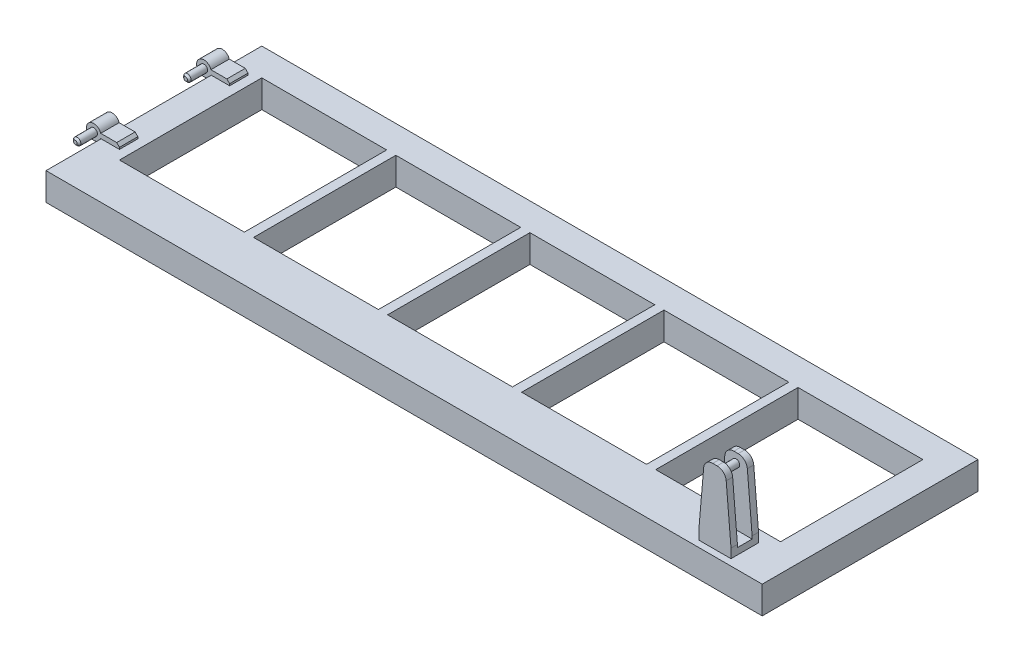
ISO-10303-21;
HEADER;
FILE_DESCRIPTION(('STEP AP214'),'2;1');
FILE_NAME('part.step','',(''),(''),'','','');
FILE_SCHEMA(('AUTOMOTIVE_DESIGN { 1 0 10303 214 1 1 1 1 }'));
ENDSEC;
DATA;
#1=APPLICATION_CONTEXT('core data for automotive mechanical design processes');
#2=APPLICATION_PROTOCOL_DEFINITION('international standard','automotive_design',2000,#1);
#3=PRODUCT_CONTEXT('',#1,'mechanical');
#4=PRODUCT('Part','Part','',(#3));
#5=PRODUCT_RELATED_PRODUCT_CATEGORY('part','',(#4));
#6=PRODUCT_DEFINITION_FORMATION('','',#4);
#7=PRODUCT_DEFINITION_CONTEXT('part definition',#1,'design');
#8=PRODUCT_DEFINITION('design','',#6,#7);
#9=PRODUCT_DEFINITION_SHAPE('','',#8);
#10=(LENGTH_UNIT() NAMED_UNIT(*) SI_UNIT(.MILLI.,.METRE.));
#11=(NAMED_UNIT(*) PLANE_ANGLE_UNIT() SI_UNIT($,.RADIAN.));
#12=(NAMED_UNIT(*) SI_UNIT($,.STERADIAN.) SOLID_ANGLE_UNIT());
#13=UNCERTAINTY_MEASURE_WITH_UNIT(LENGTH_MEASURE(1.E-05),#10,'distance_accuracy_value','');
#14=(GEOMETRIC_REPRESENTATION_CONTEXT(3) GLOBAL_UNCERTAINTY_ASSIGNED_CONTEXT((#13)) GLOBAL_UNIT_ASSIGNED_CONTEXT((#10,
#11,#12)) REPRESENTATION_CONTEXT('',''));
#15=CARTESIAN_POINT('',(0.,0.,0.));
#16=DIRECTION('',(0.,0.,1.));
#17=DIRECTION('',(1.,0.,0.));
#18=AXIS2_PLACEMENT_3D('',#15,#16,#17);
#19=CARTESIAN_POINT('',(0.,30.,235.));
#20=DIRECTION('',(0.,-1.,0.));
#21=DIRECTION('',(1.,0.,0.));
#22=AXIS2_PLACEMENT_3D('',#19,#20,#21);
#23=PLANE('',#22);
#24=DIRECTION('',(-1.,0.,0.));
#25=VECTOR('',#24,1.);
#26=CARTESIAN_POINT('',(20.,29.999999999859,35.));
#27=LINE('',#26,#25);
#28=CARTESIAN_POINT('',(20.,29.999999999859,35.));
#29=VERTEX_POINT('',#28);
#30=CARTESIAN_POINT('',(0.,30.,35.0000000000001));
#31=VERTEX_POINT('',#30);
#32=EDGE_CURVE('E437',#29,#31,#27,.T.);
#33=ORIENTED_EDGE('',*,*,#32,.F.);
#34=DIRECTION('',(0.,0.,-1.));
#35=VECTOR('',#34,1.);
#36=CARTESIAN_POINT('',(20.,29.999999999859,55.));
#37=LINE('',#36,#35);
#38=CARTESIAN_POINT('',(20.,29.999999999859,55.));
#39=VERTEX_POINT('',#38);
#40=EDGE_CURVE('E433',#39,#29,#37,.T.);
#41=ORIENTED_EDGE('',*,*,#40,.F.);
#42=DIRECTION('',(1.,0.,0.));
#43=VECTOR('',#42,1.);
#44=CARTESIAN_POINT('',(20.,29.999999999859,55.));
#45=LINE('',#44,#43);
#46=CARTESIAN_POINT('',(0.,29.999999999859,55.));
#47=VERTEX_POINT('',#46);
#48=EDGE_CURVE('E439',#47,#39,#45,.T.);
#49=ORIENTED_EDGE('',*,*,#48,.F.);
#50=DIRECTION('',(0.,0.,-1.));
#51=VECTOR('',#50,1.);
#52=CARTESIAN_POINT('',(0.,30.,235.));
#53=LINE('',#52,#51);
#54=CARTESIAN_POINT('',(0.,30.,155.));
#55=VERTEX_POINT('',#54);
#56=EDGE_CURVE('E781',#55,#47,#53,.T.);
#57=ORIENTED_EDGE('',*,*,#56,.F.);
#58=DIRECTION('',(-1.,0.,0.));
#59=VECTOR('',#58,1.);
#60=CARTESIAN_POINT('',(20.,30.,155.));
#61=LINE('',#60,#59);
#62=CARTESIAN_POINT('',(20.,30.,155.));
#63=VERTEX_POINT('',#62);
#64=EDGE_CURVE('E464',#63,#55,#61,.T.);
#65=ORIENTED_EDGE('',*,*,#64,.F.);
#66=DIRECTION('',(0.,0.,-1.));
#67=VECTOR('',#66,1.);
#68=CARTESIAN_POINT('',(20.,30.,175.));
#69=LINE('',#68,#67);
#70=CARTESIAN_POINT('',(20.,30.,175.));
#71=VERTEX_POINT('',#70);
#72=EDGE_CURVE('E460',#71,#63,#69,.T.);
#73=ORIENTED_EDGE('',*,*,#72,.F.);
#74=DIRECTION('',(1.,0.,0.));
#75=VECTOR('',#74,1.);
#76=CARTESIAN_POINT('',(20.,30.,175.));
#77=LINE('',#76,#75);
#78=CARTESIAN_POINT('',(0.,30.,175.));
#79=VERTEX_POINT('',#78);
#80=EDGE_CURVE('E470',#79,#71,#77,.T.);
#81=ORIENTED_EDGE('',*,*,#80,.F.);
#82=CARTESIAN_POINT('',(0.,30.,235.));
#83=VERTEX_POINT('',#82);
#84=EDGE_CURVE('E670',#83,#79,#53,.T.);
#85=ORIENTED_EDGE('',*,*,#84,.F.);
#86=DIRECTION('',(-1.,0.,0.));
#87=VECTOR('',#86,1.);
#88=CARTESIAN_POINT('',(0.,30.,235.));
#89=LINE('',#88,#87);
#90=CARTESIAN_POINT('',(780.,30.,235.));
#91=VERTEX_POINT('',#90);
#92=EDGE_CURVE('E681',#91,#83,#89,.T.);
#93=ORIENTED_EDGE('',*,*,#92,.F.);
#94=DIRECTION('',(0.,0.,1.));
#95=VECTOR('',#94,1.);
#96=CARTESIAN_POINT('',(780.,30.,0.));
#97=LINE('',#96,#95);
#98=CARTESIAN_POINT('',(780.,30.,0.));
#99=VERTEX_POINT('',#98);
#100=EDGE_CURVE('E573',#99,#91,#97,.T.);
#101=ORIENTED_EDGE('',*,*,#100,.F.);
#102=DIRECTION('',(-1.,0.,0.));
#103=VECTOR('',#102,1.);
#104=CARTESIAN_POINT('',(0.,30.,0.));
#105=LINE('',#104,#103);
#106=CARTESIAN_POINT('',(0.,30.,0.));
#107=VERTEX_POINT('',#106);
#108=EDGE_CURVE('E688',#99,#107,#105,.T.);
#109=ORIENTED_EDGE('',*,*,#108,.T.);
#110=EDGE_CURVE('E676',#31,#107,#53,.T.);
#111=ORIENTED_EDGE('',*,*,#110,.F.);
#112=EDGE_LOOP('',(#33,#41,#49,#57,#65,#73,#81,#85,#93,#101,#109,#111));
#113=FACE_BOUND('',#112,.T.);
#114=DIRECTION('',(-1.,0.,0.));
#115=VECTOR('',#114,1.);
#116=CARTESIAN_POINT('',(750.,30.,185.));
#117=LINE('',#116,#115);
#118=CARTESIAN_POINT('',(312.,30.,185.));
#119=VERTEX_POINT('',#118);
#120=CARTESIAN_POINT('',(176.,30.,185.));
#121=VERTEX_POINT('',#120);
#122=EDGE_CURVE('E628',#119,#121,#117,.T.);
#123=ORIENTED_EDGE('',*,*,#122,.T.);
#124=DIRECTION('',(0.,0.,1.));
#125=VECTOR('',#124,1.);
#126=CARTESIAN_POINT('',(176.,30.,-1.62277660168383));
#127=LINE('',#126,#125);
#128=CARTESIAN_POINT('',(176.,30.,30.));
#129=VERTEX_POINT('',#128);
#130=EDGE_CURVE('E529',#129,#121,#127,.T.);
#131=ORIENTED_EDGE('',*,*,#130,.F.);
#132=DIRECTION('',(-1.,0.,0.));
#133=VECTOR('',#132,1.);
#134=CARTESIAN_POINT('',(750.,30.,30.));
#135=LINE('',#134,#133);
#136=CARTESIAN_POINT('',(312.,30.,30.));
#137=VERTEX_POINT('',#136);
#138=EDGE_CURVE('E601',#137,#129,#135,.T.);
#139=ORIENTED_EDGE('',*,*,#138,.F.);
#140=DIRECTION('',(0.,0.,1.));
#141=VECTOR('',#140,1.);
#142=CARTESIAN_POINT('',(312.,30.,-1.62277660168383));
#143=LINE('',#142,#141);
#144=EDGE_CURVE('E546',#137,#119,#143,.T.);
#145=ORIENTED_EDGE('',*,*,#144,.T.);
#146=EDGE_LOOP('',(#123,#131,#139,#145));
#147=FACE_BOUND('',#146,.T.);
#148=DIRECTION('',(0.,0.,1.));
#149=VECTOR('',#148,1.);
#150=CARTESIAN_POINT('',(166.,30.,-1.62277660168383));
#151=LINE('',#150,#149);
#152=CARTESIAN_POINT('',(166.,30.,30.));
#153=VERTEX_POINT('',#152);
#154=CARTESIAN_POINT('',(166.,30.,185.));
#155=VERTEX_POINT('',#154);
#156=EDGE_CURVE('E525',#153,#155,#151,.T.);
#157=ORIENTED_EDGE('',*,*,#156,.T.);
#158=CARTESIAN_POINT('',(30.,30.,185.));
#159=VERTEX_POINT('',#158);
#160=EDGE_CURVE('E631',#155,#159,#117,.T.);
#161=ORIENTED_EDGE('',*,*,#160,.T.);
#162=DIRECTION('',(0.,0.,-1.));
#163=VECTOR('',#162,1.);
#164=CARTESIAN_POINT('',(30.,30.,235.));
#165=LINE('',#164,#163);
#166=CARTESIAN_POINT('',(30.,30.,30.0000000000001));
#167=VERTEX_POINT('',#166);
#168=EDGE_CURVE('E664',#159,#167,#165,.T.);
#169=ORIENTED_EDGE('',*,*,#168,.T.);
#170=EDGE_CURVE('E592',#153,#167,#135,.T.);
#171=ORIENTED_EDGE('',*,*,#170,.F.);
#172=EDGE_LOOP('',(#157,#161,#169,#171));
#173=FACE_BOUND('',#172,.T.);
#174=CARTESIAN_POINT('',(750.,30.,185.));
#175=VERTEX_POINT('',#174);
#176=CARTESIAN_POINT('',(614.,30.,185.));
#177=VERTEX_POINT('',#176);
#178=EDGE_CURVE('E613',#175,#177,#117,.T.);
#179=ORIENTED_EDGE('',*,*,#178,.T.);
#180=DIRECTION('',(0.,0.,1.));
#181=VECTOR('',#180,1.);
#182=CARTESIAN_POINT('',(614.,30.,-1.62277660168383));
#183=LINE('',#182,#181);
#184=CARTESIAN_POINT('',(614.,30.,30.));
#185=VERTEX_POINT('',#184);
#186=EDGE_CURVE('E507',#185,#177,#183,.T.);
#187=ORIENTED_EDGE('',*,*,#186,.F.);
#188=CARTESIAN_POINT('',(750.,30.,30.));
#189=VERTEX_POINT('',#188);
#190=EDGE_CURVE('E596',#189,#185,#135,.T.);
#191=ORIENTED_EDGE('',*,*,#190,.F.);
#192=DIRECTION('',(0.,0.,1.));
#193=VECTOR('',#192,1.);
#194=CARTESIAN_POINT('',(750.,30.,0.));
#195=LINE('',#194,#193);
#196=EDGE_CURVE('E564',#189,#175,#195,.T.);
#197=ORIENTED_EDGE('',*,*,#196,.T.);
#198=EDGE_LOOP('',(#179,#187,#191,#197));
#199=FACE_BOUND('',#198,.T.);
#200=CARTESIAN_POINT('',(604.,30.,185.));
#201=VERTEX_POINT('',#200);
#202=CARTESIAN_POINT('',(468.,30.,185.));
#203=VERTEX_POINT('',#202);
#204=EDGE_CURVE('E617',#201,#203,#117,.T.);
#205=ORIENTED_EDGE('',*,*,#204,.T.);
#206=DIRECTION('',(0.,0.,1.));
#207=VECTOR('',#206,1.);
#208=CARTESIAN_POINT('',(468.,30.,-1.62277660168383));
#209=LINE('',#208,#207);
#210=CARTESIAN_POINT('',(468.,30.,30.));
#211=VERTEX_POINT('',#210);
#212=EDGE_CURVE('E486',#211,#203,#209,.T.);
#213=ORIENTED_EDGE('',*,*,#212,.F.);
#214=CARTESIAN_POINT('',(604.,30.,30.));
#215=VERTEX_POINT('',#214);
#216=EDGE_CURVE('E599',#215,#211,#135,.T.);
#217=ORIENTED_EDGE('',*,*,#216,.F.);
#218=DIRECTION('',(0.,0.,1.));
#219=VECTOR('',#218,1.);
#220=CARTESIAN_POINT('',(604.,30.,-1.62277660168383));
#221=LINE('',#220,#219);
#222=EDGE_CURVE('E510',#215,#201,#221,.T.);
#223=ORIENTED_EDGE('',*,*,#222,.T.);
#224=EDGE_LOOP('',(#205,#213,#217,#223));
#225=FACE_BOUND('',#224,.T.);
#226=DIRECTION('',(0.,0.,1.));
#227=VECTOR('',#226,1.);
#228=CARTESIAN_POINT('',(458.,30.,-1.62277660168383));
#229=LINE('',#228,#227);
#230=CARTESIAN_POINT('',(458.,30.,30.));
#231=VERTEX_POINT('',#230);
#232=CARTESIAN_POINT('',(458.,30.,185.));
#233=VERTEX_POINT('',#232);
#234=EDGE_CURVE('E489',#231,#233,#229,.T.);
#235=ORIENTED_EDGE('',*,*,#234,.T.);
#236=CARTESIAN_POINT('',(322.,30.,185.));
#237=VERTEX_POINT('',#236);
#238=EDGE_CURVE('E636',#233,#237,#117,.T.);
#239=ORIENTED_EDGE('',*,*,#238,.T.);
#240=DIRECTION('',(0.,0.,1.));
#241=VECTOR('',#240,1.);
#242=CARTESIAN_POINT('',(322.,30.,-1.62277660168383));
#243=LINE('',#242,#241);
#244=CARTESIAN_POINT('',(322.,30.,30.));
#245=VERTEX_POINT('',#244);
#246=EDGE_CURVE('E550',#245,#237,#243,.T.);
#247=ORIENTED_EDGE('',*,*,#246,.F.);
#248=EDGE_CURVE('E600',#231,#245,#135,.T.);
#249=ORIENTED_EDGE('',*,*,#248,.F.);
#250=EDGE_LOOP('',(#235,#239,#247,#249));
#251=FACE_BOUND('',#250,.T.);
#252=DIRECTION('',(1.,0.,0.));
#253=VECTOR('',#252,1.);
#254=CARTESIAN_POINT('',(704.,30.0000000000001,228.));
#255=LINE('',#254,#253);
#256=CARTESIAN_POINT('',(704.,30.0000000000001,228.));
#257=VERTEX_POINT('',#256);
#258=CARTESIAN_POINT('',(739.,30.0000000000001,228.));
#259=VERTEX_POINT('',#258);
#260=EDGE_CURVE('E390',#257,#259,#255,.T.);
#261=ORIENTED_EDGE('',*,*,#260,.F.);
#262=DIRECTION('',(0.,0.,1.));
#263=VECTOR('',#262,1.);
#264=CARTESIAN_POINT('',(704.,30.0000000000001,198.));
#265=LINE('',#264,#263);
#266=CARTESIAN_POINT('',(704.,30.0000000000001,198.));
#267=VERTEX_POINT('',#266);
#268=EDGE_CURVE('E405',#267,#257,#265,.T.);
#269=ORIENTED_EDGE('',*,*,#268,.F.);
#270=DIRECTION('',(-1.,0.,0.));
#271=VECTOR('',#270,1.);
#272=CARTESIAN_POINT('',(704.,30.0000000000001,198.));
#273=LINE('',#272,#271);
#274=CARTESIAN_POINT('',(739.,30.0000000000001,198.));
#275=VERTEX_POINT('',#274);
#276=EDGE_CURVE('E410',#275,#267,#273,.T.);
#277=ORIENTED_EDGE('',*,*,#276,.F.);
#278=DIRECTION('',(0.,0.,-1.));
#279=VECTOR('',#278,1.);
#280=CARTESIAN_POINT('',(739.,30.0000000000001,198.));
#281=LINE('',#280,#279);
#282=EDGE_CURVE('E407',#259,#275,#281,.T.);
#283=ORIENTED_EDGE('',*,*,#282,.F.);
#284=EDGE_LOOP('',(#261,#269,#277,#283));
#285=FACE_BOUND('',#284,.T.);
#286=ADVANCED_FACE('F31',(#113,#147,#173,#199,#225,#251,#285),#23,.F.);
#287=CARTESIAN_POINT('',(704.,110.,205.));
#288=DIRECTION('',(0.,0.,-1.));
#289=DIRECTION('',(-1.,0.,0.));
#290=AXIS2_PLACEMENT_3D('',#287,#288,#289);
#291=PLANE('',#290);
#292=CARTESIAN_POINT('',(721.5,100.,205.));
#293=DIRECTION('',(0.,0.,-1.));
#294=DIRECTION('',(-1.,0.,0.));
#295=AXIS2_PLACEMENT_3D('',#292,#293,#294);
#296=CIRCLE('',#295,3.99999999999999);
#297=CARTESIAN_POINT('',(717.5,100.,205.));
#298=VERTEX_POINT('',#297);
#299=EDGE_CURVE('E387',#298,#298,#296,.T.);
#300=ORIENTED_EDGE('',*,*,#299,.T.);
#301=EDGE_LOOP('',(#300));
#302=FACE_BOUND('',#301,.T.);
#303=DIRECTION('',(-1.,0.,0.));
#304=VECTOR('',#303,1.);
#305=CARTESIAN_POINT('',(704.,37.0000000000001,205.));
#306=LINE('',#305,#304);
#307=CARTESIAN_POINT('',(739.,37.0000000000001,205.));
#308=VERTEX_POINT('',#307);
#309=CARTESIAN_POINT('',(704.,37.0000000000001,205.));
#310=VERTEX_POINT('',#309);
#311=EDGE_CURVE('E51',#308,#310,#306,.T.);
#312=ORIENTED_EDGE('',*,*,#311,.F.);
#313=DIRECTION('',(0.,-1.,0.));
#314=VECTOR('',#313,1.);
#315=CARTESIAN_POINT('',(739.,110.,205.));
#316=LINE('',#315,#314);
#317=CARTESIAN_POINT('',(739.,40.,205.));
#318=VERTEX_POINT('',#317);
#319=EDGE_CURVE('E382',#318,#308,#316,.T.);
#320=ORIENTED_EDGE('',*,*,#319,.F.);
#321=DIRECTION('',(-0.0854011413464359,0.996346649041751,0.));
#322=VECTOR('',#321,1.);
#323=CARTESIAN_POINT('',(733.,110.,205.));
#324=LINE('',#323,#322);
#325=CARTESIAN_POINT('',(733.783941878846,100.854011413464,205.));
#326=VERTEX_POINT('',#325);
#327=EDGE_CURVE('E848',#318,#326,#324,.T.);
#328=ORIENTED_EDGE('',*,*,#327,.T.);
#329=CARTESIAN_POINT('',(723.820475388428,100.,205.));
#330=DIRECTION('',(0.,0.,-1.));
#331=DIRECTION('',(-1.,0.,0.));
#332=AXIS2_PLACEMENT_3D('',#329,#330,#331);
#333=CIRCLE('',#332,10.);
#334=CARTESIAN_POINT('',(723.820475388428,110.,205.));
#335=VERTEX_POINT('',#334);
#336=EDGE_CURVE('E40',#326,#335,#333,.F.);
#337=ORIENTED_EDGE('',*,*,#336,.T.);
#338=DIRECTION('',(1.,0.,0.));
#339=VECTOR('',#338,1.);
#340=CARTESIAN_POINT('',(704.,110.,205.));
#341=LINE('',#340,#339);
#342=CARTESIAN_POINT('',(719.179524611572,110.,205.));
#343=VERTEX_POINT('',#342);
#344=EDGE_CURVE('E413',#343,#335,#341,.T.);
#345=ORIENTED_EDGE('',*,*,#344,.F.);
#346=CARTESIAN_POINT('',(719.179524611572,100.,205.));
#347=DIRECTION('',(0.,0.,-1.));
#348=DIRECTION('',(-1.,0.,0.));
#349=AXIS2_PLACEMENT_3D('',#346,#347,#348);
#350=CIRCLE('',#349,10.);
#351=CARTESIAN_POINT('',(709.216058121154,100.854011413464,205.));
#352=VERTEX_POINT('',#351);
#353=EDGE_CURVE('E896',#343,#352,#350,.F.);
#354=ORIENTED_EDGE('',*,*,#353,.T.);
#355=DIRECTION('',(-0.0854011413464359,-0.996346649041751,0.));
#356=VECTOR('',#355,1.);
#357=CARTESIAN_POINT('',(710.,110.,205.));
#358=LINE('',#357,#356);
#359=CARTESIAN_POINT('',(704.,40.0000000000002,205.));
#360=VERTEX_POINT('',#359);
#361=EDGE_CURVE('E846',#352,#360,#358,.T.);
#362=ORIENTED_EDGE('',*,*,#361,.T.);
#363=DIRECTION('',(0.,-1.,0.));
#364=VECTOR('',#363,1.);
#365=CARTESIAN_POINT('',(704.,110.,205.));
#366=LINE('',#365,#364);
#367=EDGE_CURVE('E47',#360,#310,#366,.T.);
#368=ORIENTED_EDGE('',*,*,#367,.T.);
#369=EDGE_LOOP('',(#312,#320,#328,#337,#345,#354,#362,#368));
#370=FACE_BOUND('',#369,.T.);
#371=ADVANCED_FACE('F732',(#302,#370),#291,.F.);
#372=CARTESIAN_POINT('',(704.,110.,221.));
#373=DIRECTION('',(0.,0.,1.));
#374=DIRECTION('',(1.,0.,0.));
#375=AXIS2_PLACEMENT_3D('',#372,#373,#374);
#376=PLANE('',#375);
#377=CARTESIAN_POINT('',(721.5,100.,221.));
#378=DIRECTION('',(0.,0.,1.));
#379=DIRECTION('',(1.,0.,0.));
#380=AXIS2_PLACEMENT_3D('',#377,#378,#379);
#381=CIRCLE('',#380,3.99999999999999);
#382=CARTESIAN_POINT('',(725.5,100.,221.));
#383=VERTEX_POINT('',#382);
#384=EDGE_CURVE('E35',#383,#383,#381,.T.);
#385=ORIENTED_EDGE('',*,*,#384,.T.);
#386=EDGE_LOOP('',(#385));
#387=FACE_BOUND('',#386,.T.);
#388=DIRECTION('',(1.,0.,0.));
#389=VECTOR('',#388,1.);
#390=CARTESIAN_POINT('',(704.,37.0000000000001,221.));
#391=LINE('',#390,#389);
#392=CARTESIAN_POINT('',(704.,37.0000000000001,221.));
#393=VERTEX_POINT('',#392);
#394=CARTESIAN_POINT('',(739.,37.0000000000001,221.));
#395=VERTEX_POINT('',#394);
#396=EDGE_CURVE('E362',#393,#395,#391,.T.);
#397=ORIENTED_EDGE('',*,*,#396,.F.);
#398=DIRECTION('',(0.,-1.,0.));
#399=VECTOR('',#398,1.);
#400=CARTESIAN_POINT('',(704.,110.,221.));
#401=LINE('',#400,#399);
#402=CARTESIAN_POINT('',(704.,40.0000000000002,221.));
#403=VERTEX_POINT('',#402);
#404=EDGE_CURVE('E370',#403,#393,#401,.T.);
#405=ORIENTED_EDGE('',*,*,#404,.F.);
#406=DIRECTION('',(0.0854011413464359,0.996346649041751,0.));
#407=VECTOR('',#406,1.);
#408=CARTESIAN_POINT('',(710.,110.,221.));
#409=LINE('',#408,#407);
#410=CARTESIAN_POINT('',(709.216058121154,100.854011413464,221.));
#411=VERTEX_POINT('',#410);
#412=EDGE_CURVE('E851',#403,#411,#409,.T.);
#413=ORIENTED_EDGE('',*,*,#412,.T.);
#414=CARTESIAN_POINT('',(719.179524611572,100.,221.));
#415=DIRECTION('',(0.,0.,1.));
#416=DIRECTION('',(1.,0.,0.));
#417=AXIS2_PLACEMENT_3D('',#414,#415,#416);
#418=CIRCLE('',#417,10.);
#419=CARTESIAN_POINT('',(719.179524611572,110.,221.));
#420=VERTEX_POINT('',#419);
#421=EDGE_CURVE('E872',#411,#420,#418,.F.);
#422=ORIENTED_EDGE('',*,*,#421,.T.);
#423=DIRECTION('',(-1.,0.,0.));
#424=VECTOR('',#423,1.);
#425=CARTESIAN_POINT('',(704.,110.,221.));
#426=LINE('',#425,#424);
#427=CARTESIAN_POINT('',(723.820475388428,110.,221.));
#428=VERTEX_POINT('',#427);
#429=EDGE_CURVE('E396',#428,#420,#426,.T.);
#430=ORIENTED_EDGE('',*,*,#429,.F.);
#431=CARTESIAN_POINT('',(723.820475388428,100.,221.));
#432=DIRECTION('',(0.,0.,1.));
#433=DIRECTION('',(1.,0.,0.));
#434=AXIS2_PLACEMENT_3D('',#431,#432,#433);
#435=CIRCLE('',#434,10.);
#436=CARTESIAN_POINT('',(733.783941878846,100.854011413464,221.));
#437=VERTEX_POINT('',#436);
#438=EDGE_CURVE('E874',#428,#437,#435,.F.);
#439=ORIENTED_EDGE('',*,*,#438,.T.);
#440=DIRECTION('',(0.0854011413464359,-0.996346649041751,0.));
#441=VECTOR('',#440,1.);
#442=CARTESIAN_POINT('',(733.,110.,221.));
#443=LINE('',#442,#441);
#444=CARTESIAN_POINT('',(739.,40.,221.));
#445=VERTEX_POINT('',#444);
#446=EDGE_CURVE('E365',#437,#445,#443,.T.);
#447=ORIENTED_EDGE('',*,*,#446,.T.);
#448=DIRECTION('',(0.,-1.,0.));
#449=VECTOR('',#448,1.);
#450=CARTESIAN_POINT('',(739.,110.,221.));
#451=LINE('',#450,#449);
#452=EDGE_CURVE('E358',#445,#395,#451,.T.);
#453=ORIENTED_EDGE('',*,*,#452,.T.);
#454=EDGE_LOOP('',(#397,#405,#413,#422,#430,#439,#447,#453));
#455=FACE_BOUND('',#454,.T.);
#456=ADVANCED_FACE('F360',(#387,#455),#376,.F.);
#457=CARTESIAN_POINT('',(20.,34.999999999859,55.));
#458=DIRECTION('',(0.,0.,-1.));
#459=DIRECTION('',(-1.,0.,0.));
#460=AXIS2_PLACEMENT_3D('',#457,#458,#459);
#461=PLANE('',#460);
#462=DIRECTION('',(0.,-1.,0.));
#463=VECTOR('',#462,1.);
#464=CARTESIAN_POINT('',(20.,34.999999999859,55.));
#465=LINE('',#464,#463);
#466=CARTESIAN_POINT('',(20.,31.999999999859,55.));
#467=VERTEX_POINT('',#466);
#468=EDGE_CURVE('E447',#467,#39,#465,.T.);
#469=ORIENTED_EDGE('',*,*,#468,.F.);
#470=DIRECTION('',(-0.70710678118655,0.707106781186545,0.));
#471=VECTOR('',#470,1.);
#472=CARTESIAN_POINT('',(16.9999999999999,34.999999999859,55.));
#473=LINE('',#472,#471);
#474=CARTESIAN_POINT('',(16.9999999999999,34.999999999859,55.));
#475=VERTEX_POINT('',#474);
#476=EDGE_CURVE('E808',#467,#475,#473,.T.);
#477=ORIENTED_EDGE('',*,*,#476,.T.);
#478=DIRECTION('',(1.,0.,0.));
#479=VECTOR('',#478,1.);
#480=CARTESIAN_POINT('',(20.,34.999999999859,55.));
#481=LINE('',#480,#479);
#482=CARTESIAN_POINT('',(-0.40065792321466,34.999999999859,55.));
#483=VERTEX_POINT('',#482);
#484=EDGE_CURVE('E444',#483,#475,#481,.T.);
#485=ORIENTED_EDGE('',*,*,#484,.F.);
#486=CARTESIAN_POINT('',(-8.,32.499999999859,55.));
#487=DIRECTION('',(0.,0.,1.));
#488=DIRECTION('',(1.,0.,0.));
#489=AXIS2_PLACEMENT_3D('',#486,#487,#488);
#490=CIRCLE('',#489,8.);
#491=CARTESIAN_POINT('',(-0.40065792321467,29.999999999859,55.));
#492=VERTEX_POINT('',#491);
#493=EDGE_CURVE('E425',#483,#492,#490,.T.);
#494=ORIENTED_EDGE('',*,*,#493,.T.);
#495=EDGE_CURVE('E440',#492,#47,#45,.T.);
#496=ORIENTED_EDGE('',*,*,#495,.T.);
#497=ORIENTED_EDGE('',*,*,#48,.T.);
#498=EDGE_LOOP('',(#469,#477,#485,#494,#496,#497));
#499=FACE_BOUND('',#498,.T.);
#500=CARTESIAN_POINT('',(-8.,32.499999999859,55.));
#501=DIRECTION('',(0.,0.,-1.));
#502=DIRECTION('',(-1.,0.,0.));
#503=AXIS2_PLACEMENT_3D('',#500,#501,#502);
#504=CIRCLE('',#503,4.);
#505=CARTESIAN_POINT('',(-12.,32.499999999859,55.));
#506=VERTEX_POINT('',#505);
#507=EDGE_CURVE('E1491',#506,#506,#504,.F.);
#508=ORIENTED_EDGE('',*,*,#507,.F.);
#509=EDGE_LOOP('',(#508));
#510=FACE_BOUND('',#509,.T.);
#511=ADVANCED_FACE('F804',(#499,#510),#461,.F.);
#512=CARTESIAN_POINT('',(20.,35.,175.));
#513=DIRECTION('',(0.,0.,-1.));
#514=DIRECTION('',(-1.,0.,0.));
#515=AXIS2_PLACEMENT_3D('',#512,#513,#514);
#516=PLANE('',#515);
#517=DIRECTION('',(0.,-1.,0.));
#518=VECTOR('',#517,1.);
#519=CARTESIAN_POINT('',(20.,35.,175.));
#520=LINE('',#519,#518);
#521=CARTESIAN_POINT('',(20.,32.,175.));
#522=VERTEX_POINT('',#521);
#523=EDGE_CURVE('E475',#522,#71,#520,.T.);
#524=ORIENTED_EDGE('',*,*,#523,.F.);
#525=DIRECTION('',(-0.707106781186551,0.707106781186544,0.));
#526=VECTOR('',#525,1.);
#527=CARTESIAN_POINT('',(16.9999999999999,35.,175.));
#528=LINE('',#527,#526);
#529=CARTESIAN_POINT('',(16.9999999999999,35.,175.));
#530=VERTEX_POINT('',#529);
#531=EDGE_CURVE('E837',#522,#530,#528,.T.);
#532=ORIENTED_EDGE('',*,*,#531,.T.);
#533=DIRECTION('',(1.,0.,0.));
#534=VECTOR('',#533,1.);
#535=CARTESIAN_POINT('',(20.,35.,175.));
#536=LINE('',#535,#534);
#537=CARTESIAN_POINT('',(-0.40065792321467,35.,175.));
#538=VERTEX_POINT('',#537);
#539=EDGE_CURVE('E472',#538,#530,#536,.T.);
#540=ORIENTED_EDGE('',*,*,#539,.F.);
#541=CARTESIAN_POINT('',(-8.,32.5,175.));
#542=DIRECTION('',(0.,0.,1.));
#543=DIRECTION('',(1.,0.,0.));
#544=AXIS2_PLACEMENT_3D('',#541,#542,#543);
#545=CIRCLE('',#544,8.);
#546=CARTESIAN_POINT('',(-0.400657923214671,30.,175.));
#547=VERTEX_POINT('',#546);
#548=EDGE_CURVE('E451',#538,#547,#545,.T.);
#549=ORIENTED_EDGE('',*,*,#548,.T.);
#550=EDGE_CURVE('E467',#547,#79,#77,.T.);
#551=ORIENTED_EDGE('',*,*,#550,.T.);
#552=ORIENTED_EDGE('',*,*,#80,.T.);
#553=EDGE_LOOP('',(#524,#532,#540,#549,#551,#552));
#554=FACE_BOUND('',#553,.T.);
#555=CARTESIAN_POINT('',(-8.,32.5,175.));
#556=DIRECTION('',(0.,0.,-1.));
#557=DIRECTION('',(-1.,0.,0.));
#558=AXIS2_PLACEMENT_3D('',#555,#556,#557);
#559=CIRCLE('',#558,4.00000000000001);
#560=CARTESIAN_POINT('',(-12.,32.5,175.));
#561=VERTEX_POINT('',#560);
#562=EDGE_CURVE('E1479',#561,#561,#559,.F.);
#563=ORIENTED_EDGE('',*,*,#562,.F.);
#564=EDGE_LOOP('',(#563));
#565=FACE_BOUND('',#564,.T.);
#566=ADVANCED_FACE('F1002',(#554,#565),#516,.F.);
#567=CARTESIAN_POINT('',(750.,30.,185.));
#568=DIRECTION('',(0.,0.,1.));
#569=DIRECTION('',(1.,0.,0.));
#570=AXIS2_PLACEMENT_3D('',#567,#568,#569);
#571=PLANE('',#570);
#572=ORIENTED_EDGE('',*,*,#238,.F.);
#573=DIRECTION('',(0.,-1.,0.));
#574=VECTOR('',#573,1.);
#575=CARTESIAN_POINT('',(458.,29.9999999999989,185.));
#576=LINE('',#575,#574);
#577=CARTESIAN_POINT('',(458.,0.,185.));
#578=VERTEX_POINT('',#577);
#579=EDGE_CURVE('E497',#233,#578,#576,.T.);
#580=ORIENTED_EDGE('',*,*,#579,.T.);
#581=DIRECTION('',(-1.,0.,0.));
#582=VECTOR('',#581,1.);
#583=CARTESIAN_POINT('',(750.,0.,185.));
#584=LINE('',#583,#582);
#585=CARTESIAN_POINT('',(322.,0.,185.));
#586=VERTEX_POINT('',#585);
#587=EDGE_CURVE('E639',#578,#586,#584,.T.);
#588=ORIENTED_EDGE('',*,*,#587,.T.);
#589=DIRECTION('',(0.,1.,0.));
#590=VECTOR('',#589,1.);
#591=CARTESIAN_POINT('',(322.,30.0000000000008,185.));
#592=LINE('',#591,#590);
#593=EDGE_CURVE('E561',#586,#237,#592,.T.);
#594=ORIENTED_EDGE('',*,*,#593,.T.);
#595=EDGE_LOOP('',(#572,#580,#588,#594));
#596=FACE_BOUND('',#595,.T.);
#597=ADVANCED_FACE('F1032',(#596),#571,.F.);
#598=CARTESIAN_POINT('',(750.,30.,30.));
#599=DIRECTION('',(0.,0.,-1.));
#600=DIRECTION('',(-1.,0.,0.));
#601=AXIS2_PLACEMENT_3D('',#598,#599,#600);
#602=PLANE('',#601);
#603=DIRECTION('',(-1.,0.,0.));
#604=VECTOR('',#603,1.);
#605=CARTESIAN_POINT('',(750.,0.,30.));
#606=LINE('',#605,#604);
#607=CARTESIAN_POINT('',(458.,0.,30.));
#608=VERTEX_POINT('',#607);
#609=CARTESIAN_POINT('',(322.,0.,30.));
#610=VERTEX_POINT('',#609);
#611=EDGE_CURVE('E594',#608,#610,#606,.T.);
#612=ORIENTED_EDGE('',*,*,#611,.F.);
#613=DIRECTION('',(0.,-1.,0.));
#614=VECTOR('',#613,1.);
#615=CARTESIAN_POINT('',(458.,30.,30.));
#616=LINE('',#615,#614);
#617=EDGE_CURVE('E479',#231,#608,#616,.T.);
#618=ORIENTED_EDGE('',*,*,#617,.F.);
#619=ORIENTED_EDGE('',*,*,#248,.T.);
#620=DIRECTION('',(0.,1.,0.));
#621=VECTOR('',#620,1.);
#622=CARTESIAN_POINT('',(322.,30.,30.));
#623=LINE('',#622,#621);
#624=EDGE_CURVE('E547',#610,#245,#623,.T.);
#625=ORIENTED_EDGE('',*,*,#624,.F.);
#626=EDGE_LOOP('',(#612,#618,#619,#625));
#627=FACE_BOUND('',#626,.T.);
#628=ADVANCED_FACE('F1079',(#627),#602,.F.);
#629=CARTESIAN_POINT('',(604.,0.,185.));
#630=VERTEX_POINT('',#629);
#631=CARTESIAN_POINT('',(468.,0.,185.));
#632=VERTEX_POINT('',#631);
#633=EDGE_CURVE('E637',#630,#632,#584,.T.);
#634=ORIENTED_EDGE('',*,*,#633,.T.);
#635=DIRECTION('',(0.,1.,0.));
#636=VECTOR('',#635,1.);
#637=CARTESIAN_POINT('',(468.,29.9999999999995,185.));
#638=LINE('',#637,#636);
#639=EDGE_CURVE('E494',#632,#203,#638,.T.);
#640=ORIENTED_EDGE('',*,*,#639,.T.);
#641=ORIENTED_EDGE('',*,*,#204,.F.);
#642=DIRECTION('',(0.,-1.,0.));
#643=VECTOR('',#642,1.);
#644=CARTESIAN_POINT('',(604.,30.,185.));
#645=LINE('',#644,#643);
#646=EDGE_CURVE('E518',#201,#630,#645,.T.);
#647=ORIENTED_EDGE('',*,*,#646,.T.);
#648=EDGE_LOOP('',(#634,#640,#641,#647));
#649=FACE_BOUND('',#648,.T.);
#650=ADVANCED_FACE('F1048',(#649),#571,.F.);
#651=ORIENTED_EDGE('',*,*,#216,.T.);
#652=DIRECTION('',(0.,1.,0.));
#653=VECTOR('',#652,1.);
#654=CARTESIAN_POINT('',(468.,30.,30.));
#655=LINE('',#654,#653);
#656=CARTESIAN_POINT('',(468.,0.,30.));
#657=VERTEX_POINT('',#656);
#658=EDGE_CURVE('E483',#657,#211,#655,.T.);
#659=ORIENTED_EDGE('',*,*,#658,.F.);
#660=CARTESIAN_POINT('',(604.,0.,30.));
#661=VERTEX_POINT('',#660);
#662=EDGE_CURVE('E593',#661,#657,#606,.T.);
#663=ORIENTED_EDGE('',*,*,#662,.F.);
#664=DIRECTION('',(0.,-1.,0.));
#665=VECTOR('',#664,1.);
#666=CARTESIAN_POINT('',(604.,30.,30.));
#667=LINE('',#666,#665);
#668=EDGE_CURVE('E500',#215,#661,#667,.T.);
#669=ORIENTED_EDGE('',*,*,#668,.F.);
#670=EDGE_LOOP('',(#651,#659,#663,#669));
#671=FACE_BOUND('',#670,.T.);
#672=ADVANCED_FACE('F1055',(#671),#602,.F.);
#673=CARTESIAN_POINT('',(312.,0.,185.));
#674=VERTEX_POINT('',#673);
#675=CARTESIAN_POINT('',(176.,0.,185.));
#676=VERTEX_POINT('',#675);
#677=EDGE_CURVE('E646',#674,#676,#584,.T.);
#678=ORIENTED_EDGE('',*,*,#677,.T.);
#679=DIRECTION('',(0.,1.,0.));
#680=VECTOR('',#679,1.);
#681=CARTESIAN_POINT('',(176.,30.,185.));
#682=LINE('',#681,#680);
#683=EDGE_CURVE('E539',#676,#121,#682,.T.);
#684=ORIENTED_EDGE('',*,*,#683,.T.);
#685=ORIENTED_EDGE('',*,*,#122,.F.);
#686=DIRECTION('',(0.,-1.,0.));
#687=VECTOR('',#686,1.);
#688=CARTESIAN_POINT('',(312.,30.0000000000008,185.));
#689=LINE('',#688,#687);
#690=EDGE_CURVE('E558',#119,#674,#689,.T.);
#691=ORIENTED_EDGE('',*,*,#690,.T.);
#692=EDGE_LOOP('',(#678,#684,#685,#691));
#693=FACE_BOUND('',#692,.T.);
#694=ADVANCED_FACE('F1070',(#693),#571,.F.);
#695=ORIENTED_EDGE('',*,*,#138,.T.);
#696=DIRECTION('',(0.,1.,0.));
#697=VECTOR('',#696,1.);
#698=CARTESIAN_POINT('',(176.,30.,30.));
#699=LINE('',#698,#697);
#700=CARTESIAN_POINT('',(176.,0.,30.));
#701=VERTEX_POINT('',#700);
#702=EDGE_CURVE('E526',#701,#129,#699,.T.);
#703=ORIENTED_EDGE('',*,*,#702,.F.);
#704=CARTESIAN_POINT('',(312.,0.,30.));
#705=VERTEX_POINT('',#704);
#706=EDGE_CURVE('E595',#705,#701,#606,.T.);
#707=ORIENTED_EDGE('',*,*,#706,.F.);
#708=DIRECTION('',(0.,-1.,0.));
#709=VECTOR('',#708,1.);
#710=CARTESIAN_POINT('',(312.,30.,30.));
#711=LINE('',#710,#709);
#712=EDGE_CURVE('E543',#137,#705,#711,.T.);
#713=ORIENTED_EDGE('',*,*,#712,.F.);
#714=EDGE_LOOP('',(#695,#703,#707,#713));
#715=FACE_BOUND('',#714,.T.);
#716=ADVANCED_FACE('F1064',(#715),#602,.F.);
#717=CARTESIAN_POINT('',(750.,0.,185.));
#718=VERTEX_POINT('',#717);
#719=CARTESIAN_POINT('',(614.,0.,185.));
#720=VERTEX_POINT('',#719);
#721=EDGE_CURVE('E620',#718,#720,#584,.T.);
#722=ORIENTED_EDGE('',*,*,#721,.T.);
#723=DIRECTION('',(0.,1.,0.));
#724=VECTOR('',#723,1.);
#725=CARTESIAN_POINT('',(614.,30.0000000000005,185.));
#726=LINE('',#725,#724);
#727=EDGE_CURVE('E515',#720,#177,#726,.T.);
#728=ORIENTED_EDGE('',*,*,#727,.T.);
#729=ORIENTED_EDGE('',*,*,#178,.F.);
#730=DIRECTION('',(0.,1.,0.));
#731=VECTOR('',#730,1.);
#732=CARTESIAN_POINT('',(750.,30.,185.));
#733=LINE('',#732,#731);
#734=EDGE_CURVE('E604',#718,#175,#733,.T.);
#735=ORIENTED_EDGE('',*,*,#734,.F.);
#736=EDGE_LOOP('',(#722,#728,#729,#735));
#737=FACE_BOUND('',#736,.T.);
#738=ADVANCED_FACE('F700',(#737),#571,.F.);
#739=ORIENTED_EDGE('',*,*,#190,.T.);
#740=DIRECTION('',(0.,1.,0.));
#741=VECTOR('',#740,1.);
#742=CARTESIAN_POINT('',(614.,30.,30.));
#743=LINE('',#742,#741);
#744=CARTESIAN_POINT('',(614.,0.,30.));
#745=VERTEX_POINT('',#744);
#746=EDGE_CURVE('E504',#745,#185,#743,.T.);
#747=ORIENTED_EDGE('',*,*,#746,.F.);
#748=CARTESIAN_POINT('',(750.,0.,30.));
#749=VERTEX_POINT('',#748);
#750=EDGE_CURVE('E589',#749,#745,#606,.T.);
#751=ORIENTED_EDGE('',*,*,#750,.F.);
#752=DIRECTION('',(0.,-1.,0.));
#753=VECTOR('',#752,1.);
#754=CARTESIAN_POINT('',(750.,30.,30.));
#755=LINE('',#754,#753);
#756=EDGE_CURVE('E585',#189,#749,#755,.T.);
#757=ORIENTED_EDGE('',*,*,#756,.F.);
#758=EDGE_LOOP('',(#739,#747,#751,#757));
#759=FACE_BOUND('',#758,.T.);
#760=ADVANCED_FACE('F711',(#759),#602,.F.);
#761=CARTESIAN_POINT('',(30.,0.,235.));
#762=DIRECTION('',(-1.,0.,0.));
#763=DIRECTION('',(0.,0.,1.));
#764=AXIS2_PLACEMENT_3D('',#761,#762,#763);
#765=PLANE('',#764);
#766=DIRECTION('',(0.,-1.,0.));
#767=VECTOR('',#766,1.);
#768=CARTESIAN_POINT('',(30.,30.,30.));
#769=LINE('',#768,#767);
#770=CARTESIAN_POINT('',(30.,0.,30.0000000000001));
#771=VERTEX_POINT('',#770);
#772=EDGE_CURVE('E582',#167,#771,#769,.T.);
#773=ORIENTED_EDGE('',*,*,#772,.F.);
#774=ORIENTED_EDGE('',*,*,#168,.F.);
#775=DIRECTION('',(0.,1.,0.));
#776=VECTOR('',#775,1.);
#777=CARTESIAN_POINT('',(30.,30.,185.));
#778=LINE('',#777,#776);
#779=CARTESIAN_POINT('',(30.,0.,185.));
#780=VERTEX_POINT('',#779);
#781=EDGE_CURVE('E598',#780,#159,#778,.T.);
#782=ORIENTED_EDGE('',*,*,#781,.F.);
#783=DIRECTION('',(0.,0.,-1.));
#784=VECTOR('',#783,1.);
#785=CARTESIAN_POINT('',(30.,0.,235.));
#786=LINE('',#785,#784);
#787=EDGE_CURVE('E610',#780,#771,#786,.T.);
#788=ORIENTED_EDGE('',*,*,#787,.T.);
#789=EDGE_LOOP('',(#773,#774,#782,#788));
#790=FACE_BOUND('',#789,.T.);
#791=ADVANCED_FACE('F662',(#790),#765,.F.);
#792=CARTESIAN_POINT('',(0.,0.,235.));
#793=DIRECTION('',(1.,0.,0.));
#794=DIRECTION('',(0.,0.,-1.));
#795=AXIS2_PLACEMENT_3D('',#792,#793,#794);
#796=PLANE('',#795);
#797=DIRECTION('',(0.,-1.,0.));
#798=VECTOR('',#797,1.);
#799=CARTESIAN_POINT('',(0.,0.,0.));
#800=LINE('',#799,#798);
#801=CARTESIAN_POINT('',(0.,0.,0.));
#802=VERTEX_POINT('',#801);
#803=EDGE_CURVE('E692',#107,#802,#800,.T.);
#804=ORIENTED_EDGE('',*,*,#803,.T.);
#805=DIRECTION('',(0.,0.,-1.));
#806=VECTOR('',#805,1.);
#807=CARTESIAN_POINT('',(0.,0.,235.));
#808=LINE('',#807,#806);
#809=CARTESIAN_POINT('',(0.,0.,235.));
#810=VERTEX_POINT('',#809);
#811=EDGE_CURVE('E667',#810,#802,#808,.T.);
#812=ORIENTED_EDGE('',*,*,#811,.F.);
#813=DIRECTION('',(0.,-1.,0.));
#814=VECTOR('',#813,1.);
#815=CARTESIAN_POINT('',(0.,0.,235.));
#816=LINE('',#815,#814);
#817=EDGE_CURVE('E685',#83,#810,#816,.T.);
#818=ORIENTED_EDGE('',*,*,#817,.F.);
#819=ORIENTED_EDGE('',*,*,#84,.T.);
#820=EDGE_CURVE('E674',#79,#55,#53,.T.);
#821=ORIENTED_EDGE('',*,*,#820,.T.);
#822=ORIENTED_EDGE('',*,*,#56,.T.);
#823=EDGE_CURVE('E782',#47,#31,#53,.T.);
#824=ORIENTED_EDGE('',*,*,#823,.T.);
#825=ORIENTED_EDGE('',*,*,#110,.T.);
#826=EDGE_LOOP('',(#804,#812,#818,#819,#821,#822,#824,#825));
#827=FACE_BOUND('',#826,.T.);
#828=ADVANCED_FACE('F33',(#827),#796,.F.);
#829=CARTESIAN_POINT('',(0.,0.,235.));
#830=DIRECTION('',(0.,1.,0.));
#831=DIRECTION('',(-1.,0.,0.));
#832=AXIS2_PLACEMENT_3D('',#829,#830,#831);
#833=PLANE('',#832);
#834=DIRECTION('',(0.,0.,1.));
#835=VECTOR('',#834,1.);
#836=CARTESIAN_POINT('',(468.,0.,-1.62277660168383));
#837=LINE('',#836,#835);
#838=EDGE_CURVE('E487',#657,#632,#837,.T.);
#839=ORIENTED_EDGE('',*,*,#838,.T.);
#840=ORIENTED_EDGE('',*,*,#633,.F.);
#841=DIRECTION('',(0.,0.,1.));
#842=VECTOR('',#841,1.);
#843=CARTESIAN_POINT('',(604.,0.,-1.62277660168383));
#844=LINE('',#843,#842);
#845=EDGE_CURVE('E503',#661,#630,#844,.T.);
#846=ORIENTED_EDGE('',*,*,#845,.F.);
#847=ORIENTED_EDGE('',*,*,#662,.T.);
#848=EDGE_LOOP('',(#839,#840,#846,#847));
#849=FACE_BOUND('',#848,.T.);
#850=DIRECTION('',(0.,0.,-1.));
#851=VECTOR('',#850,1.);
#852=CARTESIAN_POINT('',(780.,0.,0.));
#853=LINE('',#852,#851);
#854=CARTESIAN_POINT('',(780.,0.,235.));
#855=VERTEX_POINT('',#854);
#856=CARTESIAN_POINT('',(780.,0.,0.));
#857=VERTEX_POINT('',#856);
#858=EDGE_CURVE('E579',#855,#857,#853,.T.);
#859=ORIENTED_EDGE('',*,*,#858,.F.);
#860=DIRECTION('',(1.,0.,0.));
#861=VECTOR('',#860,1.);
#862=CARTESIAN_POINT('',(0.,0.,235.));
#863=LINE('',#862,#861);
#864=EDGE_CURVE('E683',#810,#855,#863,.T.);
#865=ORIENTED_EDGE('',*,*,#864,.F.);
#866=ORIENTED_EDGE('',*,*,#811,.T.);
#867=DIRECTION('',(1.,0.,0.));
#868=VECTOR('',#867,1.);
#869=CARTESIAN_POINT('',(0.,0.,0.));
#870=LINE('',#869,#868);
#871=EDGE_CURVE('E691',#802,#857,#870,.T.);
#872=ORIENTED_EDGE('',*,*,#871,.T.);
#873=EDGE_LOOP('',(#859,#865,#866,#872));
#874=FACE_BOUND('',#873,.T.);
#875=DIRECTION('',(0.,0.,1.));
#876=VECTOR('',#875,1.);
#877=CARTESIAN_POINT('',(614.,0.,-1.62277660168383));
#878=LINE('',#877,#876);
#879=EDGE_CURVE('E508',#745,#720,#878,.T.);
#880=ORIENTED_EDGE('',*,*,#879,.T.);
#881=ORIENTED_EDGE('',*,*,#721,.F.);
#882=DIRECTION('',(0.,0.,-1.));
#883=VECTOR('',#882,1.);
#884=CARTESIAN_POINT('',(750.,0.,0.));
#885=LINE('',#884,#883);
#886=EDGE_CURVE('E567',#718,#749,#885,.T.);
#887=ORIENTED_EDGE('',*,*,#886,.T.);
#888=ORIENTED_EDGE('',*,*,#750,.T.);
#889=EDGE_LOOP('',(#880,#881,#887,#888));
#890=FACE_BOUND('',#889,.T.);
#891=ORIENTED_EDGE('',*,*,#587,.F.);
#892=DIRECTION('',(0.,0.,1.));
#893=VECTOR('',#892,1.);
#894=CARTESIAN_POINT('',(458.,0.,-1.62277660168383));
#895=LINE('',#894,#893);
#896=EDGE_CURVE('E482',#608,#578,#895,.T.);
#897=ORIENTED_EDGE('',*,*,#896,.F.);
#898=ORIENTED_EDGE('',*,*,#611,.T.);
#899=DIRECTION('',(0.,0.,1.));
#900=VECTOR('',#899,1.);
#901=CARTESIAN_POINT('',(322.,0.,-1.62277660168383));
#902=LINE('',#901,#900);
#903=EDGE_CURVE('E542',#610,#586,#902,.T.);
#904=ORIENTED_EDGE('',*,*,#903,.T.);
#905=EDGE_LOOP('',(#891,#897,#898,#904));
#906=FACE_BOUND('',#905,.T.);
#907=DIRECTION('',(0.,0.,1.));
#908=VECTOR('',#907,1.);
#909=CARTESIAN_POINT('',(176.,0.,-1.62277660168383));
#910=LINE('',#909,#908);
#911=EDGE_CURVE('E521',#701,#676,#910,.T.);
#912=ORIENTED_EDGE('',*,*,#911,.T.);
#913=ORIENTED_EDGE('',*,*,#677,.F.);
#914=DIRECTION('',(0.,0.,1.));
#915=VECTOR('',#914,1.);
#916=CARTESIAN_POINT('',(312.,0.,-1.62277660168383));
#917=LINE('',#916,#915);
#918=EDGE_CURVE('E545',#705,#674,#917,.T.);
#919=ORIENTED_EDGE('',*,*,#918,.F.);
#920=ORIENTED_EDGE('',*,*,#706,.T.);
#921=EDGE_LOOP('',(#912,#913,#919,#920));
#922=FACE_BOUND('',#921,.T.);
#923=CARTESIAN_POINT('',(166.,0.,185.));
#924=VERTEX_POINT('',#923);
#925=EDGE_CURVE('E616',#924,#780,#584,.T.);
#926=ORIENTED_EDGE('',*,*,#925,.F.);
#927=DIRECTION('',(0.,0.,1.));
#928=VECTOR('',#927,1.);
#929=CARTESIAN_POINT('',(166.,0.,-1.62277660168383));
#930=LINE('',#929,#928);
#931=CARTESIAN_POINT('',(166.,0.,30.));
#932=VERTEX_POINT('',#931);
#933=EDGE_CURVE('E524',#932,#924,#930,.T.);
#934=ORIENTED_EDGE('',*,*,#933,.F.);
#935=EDGE_CURVE('E588',#932,#771,#606,.T.);
#936=ORIENTED_EDGE('',*,*,#935,.T.);
#937=ORIENTED_EDGE('',*,*,#787,.F.);
#938=EDGE_LOOP('',(#926,#934,#936,#937));
#939=FACE_BOUND('',#938,.T.);
#940=ADVANCED_FACE('F665',(#849,#874,#890,#906,#922,#939),#833,.F.);
#941=CARTESIAN_POINT('',(0.,30.,235.));
#942=DIRECTION('',(0.,0.,-1.));
#943=DIRECTION('',(-1.,0.,0.));
#944=AXIS2_PLACEMENT_3D('',#941,#942,#943);
#945=PLANE('',#944);
#946=ORIENTED_EDGE('',*,*,#92,.T.);
#947=ORIENTED_EDGE('',*,*,#817,.T.);
#948=ORIENTED_EDGE('',*,*,#864,.T.);
#949=DIRECTION('',(0.,-1.,0.));
#950=VECTOR('',#949,1.);
#951=CARTESIAN_POINT('',(780.,30.,235.));
#952=LINE('',#951,#950);
#953=EDGE_CURVE('E576',#91,#855,#952,.T.);
#954=ORIENTED_EDGE('',*,*,#953,.F.);
#955=EDGE_LOOP('',(#946,#947,#948,#954));
#956=FACE_BOUND('',#955,.T.);
#957=ADVANCED_FACE('F745',(#956),#945,.F.);
#958=CARTESIAN_POINT('',(0.,30.,0.));
#959=DIRECTION('',(0.,0.,-1.));
#960=DIRECTION('',(-1.,0.,0.));
#961=AXIS2_PLACEMENT_3D('',#958,#959,#960);
#962=PLANE('',#961);
#963=ORIENTED_EDGE('',*,*,#803,.F.);
#964=ORIENTED_EDGE('',*,*,#108,.F.);
#965=DIRECTION('',(0.,1.,0.));
#966=VECTOR('',#965,1.);
#967=CARTESIAN_POINT('',(780.,30.,0.));
#968=LINE('',#967,#966);
#969=EDGE_CURVE('E570',#857,#99,#968,.T.);
#970=ORIENTED_EDGE('',*,*,#969,.F.);
#971=ORIENTED_EDGE('',*,*,#871,.F.);
#972=EDGE_LOOP('',(#963,#964,#970,#971));
#973=FACE_BOUND('',#972,.T.);
#974=ADVANCED_FACE('F754',(#973),#962,.T.);
#975=ORIENTED_EDGE('',*,*,#160,.F.);
#976=DIRECTION('',(0.,-1.,0.));
#977=VECTOR('',#976,1.);
#978=CARTESIAN_POINT('',(166.,29.9999999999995,185.));
#979=LINE('',#978,#977);
#980=EDGE_CURVE('E536',#155,#924,#979,.T.);
#981=ORIENTED_EDGE('',*,*,#980,.T.);
#982=ORIENTED_EDGE('',*,*,#925,.T.);
#983=ORIENTED_EDGE('',*,*,#781,.T.);
#984=EDGE_LOOP('',(#975,#981,#982,#983));
#985=FACE_BOUND('',#984,.T.);
#986=ADVANCED_FACE('F654',(#985),#571,.F.);
#987=ORIENTED_EDGE('',*,*,#935,.F.);
#988=DIRECTION('',(0.,-1.,0.));
#989=VECTOR('',#988,1.);
#990=CARTESIAN_POINT('',(166.,30.,30.));
#991=LINE('',#990,#989);
#992=EDGE_CURVE('E522',#153,#932,#991,.T.);
#993=ORIENTED_EDGE('',*,*,#992,.F.);
#994=ORIENTED_EDGE('',*,*,#170,.T.);
#995=ORIENTED_EDGE('',*,*,#772,.T.);
#996=EDGE_LOOP('',(#987,#993,#994,#995));
#997=FACE_BOUND('',#996,.T.);
#998=ADVANCED_FACE('F1074',(#997),#602,.F.);
#999=CARTESIAN_POINT('',(750.,0.,0.));
#1000=DIRECTION('',(-1.,0.,0.));
#1001=DIRECTION('',(0.,0.,1.));
#1002=AXIS2_PLACEMENT_3D('',#999,#1000,#1001);
#1003=PLANE('',#1002);
#1004=ORIENTED_EDGE('',*,*,#734,.T.);
#1005=ORIENTED_EDGE('',*,*,#196,.F.);
#1006=ORIENTED_EDGE('',*,*,#756,.T.);
#1007=ORIENTED_EDGE('',*,*,#886,.F.);
#1008=EDGE_LOOP('',(#1004,#1005,#1006,#1007));
#1009=FACE_BOUND('',#1008,.T.);
#1010=ADVANCED_FACE('F707',(#1009),#1003,.T.);
#1011=CARTESIAN_POINT('',(780.,0.,0.));
#1012=DIRECTION('',(-1.,0.,0.));
#1013=DIRECTION('',(0.,0.,1.));
#1014=AXIS2_PLACEMENT_3D('',#1011,#1012,#1013);
#1015=PLANE('',#1014);
#1016=ORIENTED_EDGE('',*,*,#969,.T.);
#1017=ORIENTED_EDGE('',*,*,#100,.T.);
#1018=ORIENTED_EDGE('',*,*,#953,.T.);
#1019=ORIENTED_EDGE('',*,*,#858,.T.);
#1020=EDGE_LOOP('',(#1016,#1017,#1018,#1019));
#1021=FACE_BOUND('',#1020,.T.);
#1022=ADVANCED_FACE('F764',(#1021),#1015,.F.);
#1023=CARTESIAN_POINT('',(322.,30.,-1.62277660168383));
#1024=DIRECTION('',(1.,0.,0.));
#1025=DIRECTION('',(0.,1.,0.));
#1026=AXIS2_PLACEMENT_3D('',#1023,#1024,#1025);
#1027=PLANE('',#1026);
#1028=ORIENTED_EDGE('',*,*,#593,.F.);
#1029=ORIENTED_EDGE('',*,*,#903,.F.);
#1030=ORIENTED_EDGE('',*,*,#624,.T.);
#1031=ORIENTED_EDGE('',*,*,#246,.T.);
#1032=EDGE_LOOP('',(#1028,#1029,#1030,#1031));
#1033=FACE_BOUND('',#1032,.T.);
#1034=ADVANCED_FACE('F1085',(#1033),#1027,.T.);
#1035=CARTESIAN_POINT('',(312.,30.,-1.62277660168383));
#1036=DIRECTION('',(-1.,0.,0.));
#1037=DIRECTION('',(0.,-1.,0.));
#1038=AXIS2_PLACEMENT_3D('',#1035,#1036,#1037);
#1039=PLANE('',#1038);
#1040=ORIENTED_EDGE('',*,*,#690,.F.);
#1041=ORIENTED_EDGE('',*,*,#144,.F.);
#1042=ORIENTED_EDGE('',*,*,#712,.T.);
#1043=ORIENTED_EDGE('',*,*,#918,.T.);
#1044=EDGE_LOOP('',(#1040,#1041,#1042,#1043));
#1045=FACE_BOUND('',#1044,.T.);
#1046=ADVANCED_FACE('F1119',(#1045),#1039,.T.);
#1047=CARTESIAN_POINT('',(176.,30.,-1.62277660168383));
#1048=DIRECTION('',(1.,0.,0.));
#1049=DIRECTION('',(0.,0.,-1.));
#1050=AXIS2_PLACEMENT_3D('',#1047,#1048,#1049);
#1051=PLANE('',#1050);
#1052=ORIENTED_EDGE('',*,*,#683,.F.);
#1053=ORIENTED_EDGE('',*,*,#911,.F.);
#1054=ORIENTED_EDGE('',*,*,#702,.T.);
#1055=ORIENTED_EDGE('',*,*,#130,.T.);
#1056=EDGE_LOOP('',(#1052,#1053,#1054,#1055));
#1057=FACE_BOUND('',#1056,.T.);
#1058=ADVANCED_FACE('F1067',(#1057),#1051,.T.);
#1059=CARTESIAN_POINT('',(166.,30.,-1.62277660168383));
#1060=DIRECTION('',(-1.,0.,0.));
#1061=DIRECTION('',(0.,-1.,0.));
#1062=AXIS2_PLACEMENT_3D('',#1059,#1060,#1061);
#1063=PLANE('',#1062);
#1064=ORIENTED_EDGE('',*,*,#980,.F.);
#1065=ORIENTED_EDGE('',*,*,#156,.F.);
#1066=ORIENTED_EDGE('',*,*,#992,.T.);
#1067=ORIENTED_EDGE('',*,*,#933,.T.);
#1068=EDGE_LOOP('',(#1064,#1065,#1066,#1067));
#1069=FACE_BOUND('',#1068,.T.);
#1070=ADVANCED_FACE('F728',(#1069),#1063,.T.);
#1071=CARTESIAN_POINT('',(604.,30.,-1.62277660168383));
#1072=DIRECTION('',(-1.,0.,0.));
#1073=DIRECTION('',(0.,0.,1.));
#1074=AXIS2_PLACEMENT_3D('',#1071,#1072,#1073);
#1075=PLANE('',#1074);
#1076=ORIENTED_EDGE('',*,*,#646,.F.);
#1077=ORIENTED_EDGE('',*,*,#222,.F.);
#1078=ORIENTED_EDGE('',*,*,#668,.T.);
#1079=ORIENTED_EDGE('',*,*,#845,.T.);
#1080=EDGE_LOOP('',(#1076,#1077,#1078,#1079));
#1081=FACE_BOUND('',#1080,.T.);
#1082=ADVANCED_FACE('F719',(#1081),#1075,.T.);
#1083=CARTESIAN_POINT('',(614.,30.,-1.62277660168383));
#1084=DIRECTION('',(1.,0.,0.));
#1085=DIRECTION('',(0.,1.,0.));
#1086=AXIS2_PLACEMENT_3D('',#1083,#1084,#1085);
#1087=PLANE('',#1086);
#1088=ORIENTED_EDGE('',*,*,#727,.F.);
#1089=ORIENTED_EDGE('',*,*,#879,.F.);
#1090=ORIENTED_EDGE('',*,*,#746,.T.);
#1091=ORIENTED_EDGE('',*,*,#186,.T.);
#1092=EDGE_LOOP('',(#1088,#1089,#1090,#1091));
#1093=FACE_BOUND('',#1092,.T.);
#1094=ADVANCED_FACE('F716',(#1093),#1087,.T.);
#1095=CARTESIAN_POINT('',(458.,30.,-1.62277660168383));
#1096=DIRECTION('',(-1.,0.,0.));
#1097=DIRECTION('',(0.,-1.,0.));
#1098=AXIS2_PLACEMENT_3D('',#1095,#1096,#1097);
#1099=PLANE('',#1098);
#1100=ORIENTED_EDGE('',*,*,#579,.F.);
#1101=ORIENTED_EDGE('',*,*,#234,.F.);
#1102=ORIENTED_EDGE('',*,*,#617,.T.);
#1103=ORIENTED_EDGE('',*,*,#896,.T.);
#1104=EDGE_LOOP('',(#1100,#1101,#1102,#1103));
#1105=FACE_BOUND('',#1104,.T.);
#1106=ADVANCED_FACE('F718',(#1105),#1099,.T.);
#1107=CARTESIAN_POINT('',(468.,30.,-1.62277660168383));
#1108=DIRECTION('',(1.,0.,0.));
#1109=DIRECTION('',(0.,1.,0.));
#1110=AXIS2_PLACEMENT_3D('',#1107,#1108,#1109);
#1111=PLANE('',#1110);
#1112=ORIENTED_EDGE('',*,*,#639,.F.);
#1113=ORIENTED_EDGE('',*,*,#838,.F.);
#1114=ORIENTED_EDGE('',*,*,#658,.T.);
#1115=ORIENTED_EDGE('',*,*,#212,.T.);
#1116=EDGE_LOOP('',(#1112,#1113,#1114,#1115));
#1117=FACE_BOUND('',#1116,.T.);
#1118=ADVANCED_FACE('F725',(#1117),#1111,.T.);
#1119=CARTESIAN_POINT('',(20.,35.,175.));
#1120=DIRECTION('',(-1.,0.,0.));
#1121=DIRECTION('',(0.,0.,1.));
#1122=AXIS2_PLACEMENT_3D('',#1119,#1120,#1121);
#1123=PLANE('',#1122);
#1124=DIRECTION('',(0.,-1.,0.));
#1125=VECTOR('',#1124,1.);
#1126=CARTESIAN_POINT('',(20.,35.,155.));
#1127=LINE('',#1126,#1125);
#1128=CARTESIAN_POINT('',(20.,32.,155.));
#1129=VERTEX_POINT('',#1128);
#1130=EDGE_CURVE('E477',#1129,#63,#1127,.T.);
#1131=ORIENTED_EDGE('',*,*,#1130,.F.);
#1132=DIRECTION('',(0.,0.,1.));
#1133=VECTOR('',#1132,1.);
#1134=CARTESIAN_POINT('',(20.,32.,175.));
#1135=LINE('',#1134,#1133);
#1136=EDGE_CURVE('E835',#1129,#522,#1135,.T.);
#1137=ORIENTED_EDGE('',*,*,#1136,.T.);
#1138=ORIENTED_EDGE('',*,*,#523,.T.);
#1139=ORIENTED_EDGE('',*,*,#72,.T.);
#1140=EDGE_LOOP('',(#1131,#1137,#1138,#1139));
#1141=FACE_BOUND('',#1140,.T.);
#1142=ADVANCED_FACE('F1036',(#1141),#1123,.F.);
#1143=CARTESIAN_POINT('',(20.,35.,155.));
#1144=DIRECTION('',(0.,0.,1.));
#1145=DIRECTION('',(1.,0.,0.));
#1146=AXIS2_PLACEMENT_3D('',#1143,#1144,#1145);
#1147=PLANE('',#1146);
#1148=DIRECTION('',(-1.,0.,0.));
#1149=VECTOR('',#1148,1.);
#1150=CARTESIAN_POINT('',(20.,35.,155.));
#1151=LINE('',#1150,#1149);
#1152=CARTESIAN_POINT('',(16.9999999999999,35.,155.));
#1153=VERTEX_POINT('',#1152);
#1154=CARTESIAN_POINT('',(-0.40065792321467,35.,155.));
#1155=VERTEX_POINT('',#1154);
#1156=EDGE_CURVE('E469',#1153,#1155,#1151,.T.);
#1157=ORIENTED_EDGE('',*,*,#1156,.F.);
#1158=DIRECTION('',(0.707106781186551,-0.707106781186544,0.));
#1159=VECTOR('',#1158,1.);
#1160=CARTESIAN_POINT('',(16.9999999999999,35.,155.));
#1161=LINE('',#1160,#1159);
#1162=EDGE_CURVE('E833',#1153,#1129,#1161,.T.);
#1163=ORIENTED_EDGE('',*,*,#1162,.T.);
#1164=ORIENTED_EDGE('',*,*,#1130,.T.);
#1165=ORIENTED_EDGE('',*,*,#64,.T.);
#1166=CARTESIAN_POINT('',(-0.400657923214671,30.,155.));
#1167=VERTEX_POINT('',#1166);
#1168=EDGE_CURVE('E463',#55,#1167,#61,.T.);
#1169=ORIENTED_EDGE('',*,*,#1168,.T.);
#1170=CARTESIAN_POINT('',(-8.,32.5,155.));
#1171=DIRECTION('',(0.,0.,1.));
#1172=DIRECTION('',(1.,0.,0.));
#1173=AXIS2_PLACEMENT_3D('',#1170,#1171,#1172);
#1174=CIRCLE('',#1173,8.);
#1175=EDGE_CURVE('E454',#1167,#1155,#1174,.F.);
#1176=ORIENTED_EDGE('',*,*,#1175,.T.);
#1177=EDGE_LOOP('',(#1157,#1163,#1164,#1165,#1169,#1176));
#1178=FACE_BOUND('',#1177,.T.);
#1179=ADVANCED_FACE('F1028',(#1178),#1147,.F.);
#1180=CARTESIAN_POINT('',(20.,35.,155.));
#1181=DIRECTION('',(0.,1.,0.));
#1182=DIRECTION('',(-1.,0.,0.));
#1183=AXIS2_PLACEMENT_3D('',#1180,#1181,#1182);
#1184=PLANE('',#1183);
#1185=ORIENTED_EDGE('',*,*,#539,.T.);
#1186=DIRECTION('',(0.,0.,-1.));
#1187=VECTOR('',#1186,1.);
#1188=CARTESIAN_POINT('',(16.9999999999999,35.,155.));
#1189=LINE('',#1188,#1187);
#1190=EDGE_CURVE('E830',#530,#1153,#1189,.T.);
#1191=ORIENTED_EDGE('',*,*,#1190,.T.);
#1192=ORIENTED_EDGE('',*,*,#1156,.T.);
#1193=DIRECTION('',(0.,0.,1.));
#1194=VECTOR('',#1193,1.);
#1195=CARTESIAN_POINT('',(-0.400657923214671,35.,132.37258300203));
#1196=LINE('',#1195,#1194);
#1197=EDGE_CURVE('E457',#538,#1155,#1196,.F.);
#1198=ORIENTED_EDGE('',*,*,#1197,.F.);
#1199=EDGE_LOOP('',(#1185,#1191,#1192,#1198));
#1200=FACE_BOUND('',#1199,.T.);
#1201=ADVANCED_FACE('F1025',(#1200),#1184,.T.);
#1202=CARTESIAN_POINT('',(20.,30.,155.));
#1203=DIRECTION('',(0.,1.,0.));
#1204=DIRECTION('',(-1.,0.,0.));
#1205=AXIS2_PLACEMENT_3D('',#1202,#1203,#1204);
#1206=PLANE('',#1205);
#1207=ORIENTED_EDGE('',*,*,#550,.F.);
#1208=DIRECTION('',(0.,0.,1.));
#1209=VECTOR('',#1208,1.);
#1210=CARTESIAN_POINT('',(-0.400657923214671,30.,132.37258300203));
#1211=LINE('',#1210,#1209);
#1212=EDGE_CURVE('E1478',#547,#1167,#1211,.F.);
#1213=ORIENTED_EDGE('',*,*,#1212,.T.);
#1214=ORIENTED_EDGE('',*,*,#1168,.F.);
#1215=ORIENTED_EDGE('',*,*,#820,.F.);
#1216=EDGE_LOOP('',(#1207,#1213,#1214,#1215));
#1217=FACE_BOUND('',#1216,.T.);
#1218=ADVANCED_FACE('F778',(#1217),#1206,.F.);
#1219=CARTESIAN_POINT('',(-8.,32.5,132.37258300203));
#1220=DIRECTION('',(0.,0.,1.));
#1221=DIRECTION('',(1.,0.,0.));
#1222=AXIS2_PLACEMENT_3D('',#1219,#1220,#1221);
#1223=CYLINDRICAL_SURFACE('',#1222,8.);
#1224=ORIENTED_EDGE('',*,*,#548,.F.);
#1225=ORIENTED_EDGE('',*,*,#1197,.T.);
#1226=ORIENTED_EDGE('',*,*,#1175,.F.);
#1227=ORIENTED_EDGE('',*,*,#1212,.F.);
#1228=EDGE_LOOP('',(#1224,#1225,#1226,#1227));
#1229=FACE_BOUND('',#1228,.T.);
#1230=ADVANCED_FACE('F1018',(#1229),#1223,.T.);
#1231=CARTESIAN_POINT('',(-8.,32.5,195.));
#1232=DIRECTION('',(0.,0.,-1.));
#1233=DIRECTION('',(-1.,0.,0.));
#1234=AXIS2_PLACEMENT_3D('',#1231,#1232,#1233);
#1235=CYLINDRICAL_SURFACE('',#1234,4.00000000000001);
#1236=CARTESIAN_POINT('',(-8.,32.5,193.));
#1237=DIRECTION('',(0.,0.,1.));
#1238=DIRECTION('',(1.,0.,0.));
#1239=AXIS2_PLACEMENT_3D('',#1236,#1237,#1238);
#1240=CIRCLE('',#1239,4.00000000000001);
#1241=CARTESIAN_POINT('',(-4.,32.5,193.));
#1242=VERTEX_POINT('',#1241);
#1243=EDGE_CURVE('E1487',#1242,#1242,#1240,.F.);
#1244=ORIENTED_EDGE('',*,*,#1243,.T.);
#1245=EDGE_LOOP('',(#1244));
#1246=FACE_BOUND('',#1245,.T.);
#1247=ORIENTED_EDGE('',*,*,#562,.T.);
#1248=EDGE_LOOP('',(#1247));
#1249=FACE_BOUND('',#1248,.T.);
#1250=ADVANCED_FACE('F1014',(#1246,#1249),#1235,.T.);
#1251=CARTESIAN_POINT('',(-8.,32.5,195.));
#1252=DIRECTION('',(0.,0.,1.));
#1253=DIRECTION('',(1.,0.,0.));
#1254=AXIS2_PLACEMENT_3D('',#1251,#1252,#1253);
#1255=PLANE('',#1254);
#1256=CARTESIAN_POINT('',(-8.,32.5,195.));
#1257=DIRECTION('',(0.,0.,1.));
#1258=DIRECTION('',(1.,0.,0.));
#1259=AXIS2_PLACEMENT_3D('',#1256,#1257,#1258);
#1260=CIRCLE('',#1259,2.);
#1261=CARTESIAN_POINT('',(-6.,32.5,195.));
#1262=VERTEX_POINT('',#1261);
#1263=EDGE_CURVE('E1482',#1262,#1262,#1260,.T.);
#1264=ORIENTED_EDGE('',*,*,#1263,.T.);
#1265=EDGE_LOOP('',(#1264));
#1266=FACE_BOUND('',#1265,.T.);
#1267=ADVANCED_FACE('F1010',(#1266),#1255,.T.);
#1268=CARTESIAN_POINT('',(-8.,32.5,195.));
#1269=DIRECTION('',(0.,0.,-1.));
#1270=DIRECTION('',(-1.,0.,0.));
#1271=AXIS2_PLACEMENT_3D('',#1268,#1269,#1270);
#1272=CONICAL_SURFACE('',#1271,2.,0.785398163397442);
#1273=ORIENTED_EDGE('',*,*,#1243,.F.);
#1274=EDGE_LOOP('',(#1273));
#1275=FACE_BOUND('',#1274,.T.);
#1276=ORIENTED_EDGE('',*,*,#1263,.F.);
#1277=EDGE_LOOP('',(#1276));
#1278=FACE_BOUND('',#1277,.T.);
#1279=ADVANCED_FACE('F997',(#1275,#1278),#1272,.T.);
#1280=CARTESIAN_POINT('',(20.,29.999999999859,55.));
#1281=DIRECTION('',(0.,1.,0.));
#1282=DIRECTION('',(0.,0.,1.));
#1283=AXIS2_PLACEMENT_3D('',#1280,#1281,#1282);
#1284=PLANE('',#1283);
#1285=ORIENTED_EDGE('',*,*,#495,.F.);
#1286=DIRECTION('',(0.,0.,1.));
#1287=VECTOR('',#1286,1.);
#1288=CARTESIAN_POINT('',(-0.400657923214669,29.999999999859,12.3725830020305));
#1289=LINE('',#1288,#1287);
#1290=CARTESIAN_POINT('',(-0.400657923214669,29.999999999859,35.));
#1291=VERTEX_POINT('',#1290);
#1292=EDGE_CURVE('E431',#492,#1291,#1289,.F.);
#1293=ORIENTED_EDGE('',*,*,#1292,.T.);
#1294=EDGE_CURVE('E436',#31,#1291,#27,.T.);
#1295=ORIENTED_EDGE('',*,*,#1294,.F.);
#1296=ORIENTED_EDGE('',*,*,#823,.F.);
#1297=EDGE_LOOP('',(#1285,#1293,#1295,#1296));
#1298=FACE_BOUND('',#1297,.T.);
#1299=ADVANCED_FACE('F795',(#1298),#1284,.F.);
#1300=CARTESIAN_POINT('',(20.,34.999999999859,55.));
#1301=DIRECTION('',(-1.,0.,0.));
#1302=DIRECTION('',(0.,0.,1.));
#1303=AXIS2_PLACEMENT_3D('',#1300,#1301,#1302);
#1304=PLANE('',#1303);
#1305=DIRECTION('',(0.,-1.,0.));
#1306=VECTOR('',#1305,1.);
#1307=CARTESIAN_POINT('',(20.,34.999999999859,35.));
#1308=LINE('',#1307,#1306);
#1309=CARTESIAN_POINT('',(20.,31.999999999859,35.));
#1310=VERTEX_POINT('',#1309);
#1311=EDGE_CURVE('E449',#1310,#29,#1308,.T.);
#1312=ORIENTED_EDGE('',*,*,#1311,.F.);
#1313=DIRECTION('',(0.,0.,1.));
#1314=VECTOR('',#1313,1.);
#1315=CARTESIAN_POINT('',(20.,31.999999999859,55.));
#1316=LINE('',#1315,#1314);
#1317=EDGE_CURVE('E821',#1310,#467,#1316,.T.);
#1318=ORIENTED_EDGE('',*,*,#1317,.T.);
#1319=ORIENTED_EDGE('',*,*,#468,.T.);
#1320=ORIENTED_EDGE('',*,*,#40,.T.);
#1321=EDGE_LOOP('',(#1312,#1318,#1319,#1320));
#1322=FACE_BOUND('',#1321,.T.);
#1323=ADVANCED_FACE('F996',(#1322),#1304,.F.);
#1324=CARTESIAN_POINT('',(20.,34.999999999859,35.));
#1325=DIRECTION('',(0.,0.,1.));
#1326=DIRECTION('',(1.,0.,0.));
#1327=AXIS2_PLACEMENT_3D('',#1324,#1325,#1326);
#1328=PLANE('',#1327);
#1329=DIRECTION('',(-1.,0.,0.));
#1330=VECTOR('',#1329,1.);
#1331=CARTESIAN_POINT('',(20.,34.999999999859,35.));
#1332=LINE('',#1331,#1330);
#1333=CARTESIAN_POINT('',(16.9999999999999,34.999999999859,35.));
#1334=VERTEX_POINT('',#1333);
#1335=CARTESIAN_POINT('',(-0.400657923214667,34.999999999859,35.));
#1336=VERTEX_POINT('',#1335);
#1337=EDGE_CURVE('E442',#1334,#1336,#1332,.T.);
#1338=ORIENTED_EDGE('',*,*,#1337,.F.);
#1339=DIRECTION('',(0.70710678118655,-0.707106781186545,0.));
#1340=VECTOR('',#1339,1.);
#1341=CARTESIAN_POINT('',(16.9999999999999,34.999999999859,35.));
#1342=LINE('',#1341,#1340);
#1343=EDGE_CURVE('E818',#1334,#1310,#1342,.T.);
#1344=ORIENTED_EDGE('',*,*,#1343,.T.);
#1345=ORIENTED_EDGE('',*,*,#1311,.T.);
#1346=ORIENTED_EDGE('',*,*,#32,.T.);
#1347=ORIENTED_EDGE('',*,*,#1294,.T.);
#1348=CARTESIAN_POINT('',(-8.,32.499999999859,35.));
#1349=DIRECTION('',(0.,0.,1.));
#1350=DIRECTION('',(1.,0.,0.));
#1351=AXIS2_PLACEMENT_3D('',#1348,#1349,#1350);
#1352=CIRCLE('',#1351,8.);
#1353=EDGE_CURVE('E428',#1291,#1336,#1352,.F.);
#1354=ORIENTED_EDGE('',*,*,#1353,.T.);
#1355=EDGE_LOOP('',(#1338,#1344,#1345,#1346,#1347,#1354));
#1356=FACE_BOUND('',#1355,.T.);
#1357=ADVANCED_FACE('F791',(#1356),#1328,.F.);
#1358=CARTESIAN_POINT('',(20.,34.999999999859,55.));
#1359=DIRECTION('',(0.,1.,0.));
#1360=DIRECTION('',(0.,0.,1.));
#1361=AXIS2_PLACEMENT_3D('',#1358,#1359,#1360);
#1362=PLANE('',#1361);
#1363=ORIENTED_EDGE('',*,*,#484,.T.);
#1364=DIRECTION('',(0.,0.,-1.));
#1365=VECTOR('',#1364,1.);
#1366=CARTESIAN_POINT('',(17.,34.999999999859,35.));
#1367=LINE('',#1366,#1365);
#1368=EDGE_CURVE('E813',#475,#1334,#1367,.T.);
#1369=ORIENTED_EDGE('',*,*,#1368,.T.);
#1370=ORIENTED_EDGE('',*,*,#1337,.T.);
#1371=DIRECTION('',(0.,0.,1.));
#1372=VECTOR('',#1371,1.);
#1373=CARTESIAN_POINT('',(-0.400657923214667,34.999999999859,12.3725830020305));
#1374=LINE('',#1373,#1372);
#1375=EDGE_CURVE('E814',#483,#1336,#1374,.F.);
#1376=ORIENTED_EDGE('',*,*,#1375,.F.);
#1377=EDGE_LOOP('',(#1363,#1369,#1370,#1376));
#1378=FACE_BOUND('',#1377,.T.);
#1379=ADVANCED_FACE('F812',(#1378),#1362,.T.);
#1380=CARTESIAN_POINT('',(-8.,32.499999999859,12.3725830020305));
#1381=DIRECTION('',(0.,0.,1.));
#1382=DIRECTION('',(1.,0.,0.));
#1383=AXIS2_PLACEMENT_3D('',#1380,#1381,#1382);
#1384=CYLINDRICAL_SURFACE('',#1383,8.);
#1385=ORIENTED_EDGE('',*,*,#1292,.F.);
#1386=ORIENTED_EDGE('',*,*,#493,.F.);
#1387=ORIENTED_EDGE('',*,*,#1375,.T.);
#1388=ORIENTED_EDGE('',*,*,#1353,.F.);
#1389=EDGE_LOOP('',(#1385,#1386,#1387,#1388));
#1390=FACE_BOUND('',#1389,.T.);
#1391=ADVANCED_FACE('F799',(#1390),#1384,.T.);
#1392=CARTESIAN_POINT('',(-8.,32.499999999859,75.));
#1393=DIRECTION('',(0.,0.,-1.));
#1394=DIRECTION('',(-1.,0.,0.));
#1395=AXIS2_PLACEMENT_3D('',#1392,#1393,#1394);
#1396=CYLINDRICAL_SURFACE('',#1395,4.);
#1397=CARTESIAN_POINT('',(-8.,32.499999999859,73.));
#1398=DIRECTION('',(0.,0.,1.));
#1399=DIRECTION('',(1.,0.,0.));
#1400=AXIS2_PLACEMENT_3D('',#1397,#1398,#1399);
#1401=CIRCLE('',#1400,4.);
#1402=CARTESIAN_POINT('',(-4.,32.499999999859,73.));
#1403=VERTEX_POINT('',#1402);
#1404=EDGE_CURVE('E819',#1403,#1403,#1401,.F.);
#1405=ORIENTED_EDGE('',*,*,#1404,.T.);
#1406=EDGE_LOOP('',(#1405));
#1407=FACE_BOUND('',#1406,.T.);
#1408=ORIENTED_EDGE('',*,*,#507,.T.);
#1409=EDGE_LOOP('',(#1408));
#1410=FACE_BOUND('',#1409,.T.);
#1411=ADVANCED_FACE('F987',(#1407,#1410),#1396,.T.);
#1412=CARTESIAN_POINT('',(-8.,32.499999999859,75.));
#1413=DIRECTION('',(0.,0.,1.));
#1414=DIRECTION('',(1.,0.,0.));
#1415=AXIS2_PLACEMENT_3D('',#1412,#1413,#1414);
#1416=PLANE('',#1415);
#1417=CARTESIAN_POINT('',(-8.,32.499999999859,75.));
#1418=DIRECTION('',(0.,0.,1.));
#1419=DIRECTION('',(1.,0.,0.));
#1420=AXIS2_PLACEMENT_3D('',#1417,#1418,#1419);
#1421=CIRCLE('',#1420,2.);
#1422=CARTESIAN_POINT('',(-6.,32.499999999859,75.));
#1423=VERTEX_POINT('',#1422);
#1424=EDGE_CURVE('E824',#1423,#1423,#1421,.T.);
#1425=ORIENTED_EDGE('',*,*,#1424,.T.);
#1426=EDGE_LOOP('',(#1425));
#1427=FACE_BOUND('',#1426,.T.);
#1428=ADVANCED_FACE('F983',(#1427),#1416,.T.);
#1429=CARTESIAN_POINT('',(-8.,32.499999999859,75.));
#1430=DIRECTION('',(0.,0.,-1.));
#1431=DIRECTION('',(-1.,0.,0.));
#1432=AXIS2_PLACEMENT_3D('',#1429,#1430,#1431);
#1433=CONICAL_SURFACE('',#1432,2.,0.785398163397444);
#1434=ORIENTED_EDGE('',*,*,#1404,.F.);
#1435=EDGE_LOOP('',(#1434));
#1436=FACE_BOUND('',#1435,.T.);
#1437=ORIENTED_EDGE('',*,*,#1424,.F.);
#1438=EDGE_LOOP('',(#1437));
#1439=FACE_BOUND('',#1438,.T.);
#1440=ADVANCED_FACE('F980',(#1436,#1439),#1433,.T.);
#1441=CARTESIAN_POINT('',(16.9999999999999,34.999999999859,55.));
#1442=DIRECTION('',(0.707106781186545,0.70710678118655,0.));
#1443=DIRECTION('',(-0.70710678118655,0.707106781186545,0.));
#1444=AXIS2_PLACEMENT_3D('',#1441,#1442,#1443);
#1445=PLANE('',#1444);
#1446=ORIENTED_EDGE('',*,*,#476,.F.);
#1447=ORIENTED_EDGE('',*,*,#1317,.F.);
#1448=ORIENTED_EDGE('',*,*,#1343,.F.);
#1449=ORIENTED_EDGE('',*,*,#1368,.F.);
#1450=EDGE_LOOP('',(#1446,#1447,#1448,#1449));
#1451=FACE_BOUND('',#1450,.T.);
#1452=ADVANCED_FACE('F816',(#1451),#1445,.T.);
#1453=CARTESIAN_POINT('',(16.9999999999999,35.,155.));
#1454=DIRECTION('',(0.707106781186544,0.707106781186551,0.));
#1455=DIRECTION('',(-0.707106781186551,0.707106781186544,0.));
#1456=AXIS2_PLACEMENT_3D('',#1453,#1454,#1455);
#1457=PLANE('',#1456);
#1458=ORIENTED_EDGE('',*,*,#531,.F.);
#1459=ORIENTED_EDGE('',*,*,#1136,.F.);
#1460=ORIENTED_EDGE('',*,*,#1162,.F.);
#1461=ORIENTED_EDGE('',*,*,#1190,.F.);
#1462=EDGE_LOOP('',(#1458,#1459,#1460,#1461));
#1463=FACE_BOUND('',#1462,.T.);
#1464=ADVANCED_FACE('F974',(#1463),#1457,.T.);
#1465=CARTESIAN_POINT('',(704.,110.,198.));
#1466=DIRECTION('',(1.,0.,0.));
#1467=DIRECTION('',(0.,1.,0.));
#1468=AXIS2_PLACEMENT_3D('',#1465,#1466,#1467);
#1469=PLANE('',#1468);
#1470=ORIENTED_EDGE('',*,*,#367,.F.);
#1471=DIRECTION('',(0.,0.,-1.));
#1472=VECTOR('',#1471,1.);
#1473=CARTESIAN_POINT('',(704.,40.0000000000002,198.));
#1474=LINE('',#1473,#1472);
#1475=CARTESIAN_POINT('',(704.,40.0000000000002,198.));
#1476=VERTEX_POINT('',#1475);
#1477=EDGE_CURVE('E864',#360,#1476,#1474,.T.);
#1478=ORIENTED_EDGE('',*,*,#1477,.T.);
#1479=DIRECTION('',(0.,-1.,0.));
#1480=VECTOR('',#1479,1.);
#1481=CARTESIAN_POINT('',(704.,110.,198.));
#1482=LINE('',#1481,#1480);
#1483=EDGE_CURVE('E419',#1476,#267,#1482,.T.);
#1484=ORIENTED_EDGE('',*,*,#1483,.T.);
#1485=ORIENTED_EDGE('',*,*,#268,.T.);
#1486=DIRECTION('',(0.,-1.,0.));
#1487=VECTOR('',#1486,1.);
#1488=CARTESIAN_POINT('',(704.,110.,228.));
#1489=LINE('',#1488,#1487);
#1490=CARTESIAN_POINT('',(704.,40.0000000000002,228.));
#1491=VERTEX_POINT('',#1490);
#1492=EDGE_CURVE('E402',#1491,#257,#1489,.T.);
#1493=ORIENTED_EDGE('',*,*,#1492,.F.);
#1494=DIRECTION('',(0.,0.,-1.));
#1495=VECTOR('',#1494,1.);
#1496=CARTESIAN_POINT('',(704.,40.0000000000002,221.));
#1497=LINE('',#1496,#1495);
#1498=EDGE_CURVE('E862',#1491,#403,#1497,.T.);
#1499=ORIENTED_EDGE('',*,*,#1498,.T.);
#1500=ORIENTED_EDGE('',*,*,#404,.T.);
#1501=DIRECTION('',(0.,0.,1.));
#1502=VECTOR('',#1501,1.);
#1503=CARTESIAN_POINT('',(704.,37.0000000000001,221.));
#1504=LINE('',#1503,#1502);
#1505=EDGE_CURVE('E378',#310,#393,#1504,.T.);
#1506=ORIENTED_EDGE('',*,*,#1505,.F.);
#1507=EDGE_LOOP('',(#1470,#1478,#1484,#1485,#1493,#1499,#1500,#1506));
#1508=FACE_BOUND('',#1507,.T.);
#1509=ADVANCED_FACE('F922',(#1508),#1469,.F.);
#1510=CARTESIAN_POINT('',(739.,110.,198.));
#1511=DIRECTION('',(-1.,0.,0.));
#1512=DIRECTION('',(0.,-1.,0.));
#1513=AXIS2_PLACEMENT_3D('',#1510,#1511,#1512);
#1514=PLANE('',#1513);
#1515=DIRECTION('',(0.,-1.,0.));
#1516=VECTOR('',#1515,1.);
#1517=CARTESIAN_POINT('',(739.,110.,198.));
#1518=LINE('',#1517,#1516);
#1519=CARTESIAN_POINT('',(739.,40.,198.));
#1520=VERTEX_POINT('',#1519);
#1521=EDGE_CURVE('E421',#1520,#275,#1518,.T.);
#1522=ORIENTED_EDGE('',*,*,#1521,.F.);
#1523=DIRECTION('',(0.,0.,1.));
#1524=VECTOR('',#1523,1.);
#1525=CARTESIAN_POINT('',(739.,40.,205.));
#1526=LINE('',#1525,#1524);
#1527=EDGE_CURVE('E844',#1520,#318,#1526,.T.);
#1528=ORIENTED_EDGE('',*,*,#1527,.T.);
#1529=ORIENTED_EDGE('',*,*,#319,.T.);
#1530=DIRECTION('',(0.,0.,-1.));
#1531=VECTOR('',#1530,1.);
#1532=CARTESIAN_POINT('',(739.,37.0000000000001,221.));
#1533=LINE('',#1532,#1531);
#1534=EDGE_CURVE('E376',#395,#308,#1533,.T.);
#1535=ORIENTED_EDGE('',*,*,#1534,.F.);
#1536=ORIENTED_EDGE('',*,*,#452,.F.);
#1537=DIRECTION('',(0.,0.,1.));
#1538=VECTOR('',#1537,1.);
#1539=CARTESIAN_POINT('',(739.,40.,228.));
#1540=LINE('',#1539,#1538);
#1541=CARTESIAN_POINT('',(739.,40.,228.));
#1542=VERTEX_POINT('',#1541);
#1543=EDGE_CURVE('E855',#445,#1542,#1540,.T.);
#1544=ORIENTED_EDGE('',*,*,#1543,.T.);
#1545=DIRECTION('',(0.,-1.,0.));
#1546=VECTOR('',#1545,1.);
#1547=CARTESIAN_POINT('',(739.,110.,228.));
#1548=LINE('',#1547,#1546);
#1549=EDGE_CURVE('E369',#1542,#259,#1548,.T.);
#1550=ORIENTED_EDGE('',*,*,#1549,.T.);
#1551=ORIENTED_EDGE('',*,*,#282,.T.);
#1552=EDGE_LOOP('',(#1522,#1528,#1529,#1535,#1536,#1544,#1550,#1551));
#1553=FACE_BOUND('',#1552,.T.);
#1554=ADVANCED_FACE('F381',(#1553),#1514,.F.);
#1555=CARTESIAN_POINT('',(704.,110.,198.));
#1556=DIRECTION('',(0.,0.,1.));
#1557=DIRECTION('',(1.,0.,0.));
#1558=AXIS2_PLACEMENT_3D('',#1555,#1556,#1557);
#1559=PLANE('',#1558);
#1560=DIRECTION('',(-1.,0.,0.));
#1561=VECTOR('',#1560,1.);
#1562=CARTESIAN_POINT('',(704.,110.,198.));
#1563=LINE('',#1562,#1561);
#1564=CARTESIAN_POINT('',(723.820475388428,110.,198.));
#1565=VERTEX_POINT('',#1564);
#1566=CARTESIAN_POINT('',(719.179524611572,110.,198.));
#1567=VERTEX_POINT('',#1566);
#1568=EDGE_CURVE('E416',#1565,#1567,#1563,.T.);
#1569=ORIENTED_EDGE('',*,*,#1568,.F.);
#1570=CARTESIAN_POINT('',(723.820475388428,100.,198.));
#1571=DIRECTION('',(0.,0.,1.));
#1572=DIRECTION('',(1.,0.,0.));
#1573=AXIS2_PLACEMENT_3D('',#1570,#1571,#1572);
#1574=CIRCLE('',#1573,10.);
#1575=CARTESIAN_POINT('',(733.783941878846,100.854011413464,198.));
#1576=VERTEX_POINT('',#1575);
#1577=EDGE_CURVE('E892',#1565,#1576,#1574,.F.);
#1578=ORIENTED_EDGE('',*,*,#1577,.T.);
#1579=DIRECTION('',(0.0854011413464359,-0.996346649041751,0.));
#1580=VECTOR('',#1579,1.);
#1581=CARTESIAN_POINT('',(733.,110.,198.));
#1582=LINE('',#1581,#1580);
#1583=EDGE_CURVE('E842',#1576,#1520,#1582,.T.);
#1584=ORIENTED_EDGE('',*,*,#1583,.T.);
#1585=ORIENTED_EDGE('',*,*,#1521,.T.);
#1586=ORIENTED_EDGE('',*,*,#276,.T.);
#1587=ORIENTED_EDGE('',*,*,#1483,.F.);
#1588=DIRECTION('',(0.0854011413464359,0.996346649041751,0.));
#1589=VECTOR('',#1588,1.);
#1590=CARTESIAN_POINT('',(710.,110.,198.));
#1591=LINE('',#1590,#1589);
#1592=CARTESIAN_POINT('',(709.216058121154,100.854011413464,198.));
#1593=VERTEX_POINT('',#1592);
#1594=EDGE_CURVE('E839',#1476,#1593,#1591,.T.);
#1595=ORIENTED_EDGE('',*,*,#1594,.T.);
#1596=CARTESIAN_POINT('',(719.179524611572,100.,198.));
#1597=DIRECTION('',(0.,0.,1.));
#1598=DIRECTION('',(1.,0.,0.));
#1599=AXIS2_PLACEMENT_3D('',#1596,#1597,#1598);
#1600=CIRCLE('',#1599,10.);
#1601=EDGE_CURVE('E890',#1593,#1567,#1600,.F.);
#1602=ORIENTED_EDGE('',*,*,#1601,.T.);
#1603=EDGE_LOOP('',(#1569,#1578,#1584,#1585,#1586,#1587,#1595,#1602));
#1604=FACE_BOUND('',#1603,.T.);
#1605=ADVANCED_FACE('F911',(#1604),#1559,.F.);
#1606=CARTESIAN_POINT('',(704.,110.,205.));
#1607=DIRECTION('',(0.,1.,0.));
#1608=DIRECTION('',(-1.,0.,0.));
#1609=AXIS2_PLACEMENT_3D('',#1606,#1607,#1608);
#1610=PLANE('',#1609);
#1611=ORIENTED_EDGE('',*,*,#344,.T.);
#1612=DIRECTION('',(0.,0.,-1.));
#1613=VECTOR('',#1612,1.);
#1614=CARTESIAN_POINT('',(723.820475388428,110.,205.));
#1615=LINE('',#1614,#1613);
#1616=EDGE_CURVE('E887',#335,#1565,#1615,.T.);
#1617=ORIENTED_EDGE('',*,*,#1616,.T.);
#1618=ORIENTED_EDGE('',*,*,#1568,.T.);
#1619=DIRECTION('',(0.,0.,1.));
#1620=VECTOR('',#1619,1.);
#1621=CARTESIAN_POINT('',(719.179524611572,110.,205.));
#1622=LINE('',#1621,#1620);
#1623=EDGE_CURVE('E884',#1567,#343,#1622,.T.);
#1624=ORIENTED_EDGE('',*,*,#1623,.T.);
#1625=EDGE_LOOP('',(#1611,#1617,#1618,#1624));
#1626=FACE_BOUND('',#1625,.T.);
#1627=ADVANCED_FACE('F905',(#1626),#1610,.T.);
#1628=CARTESIAN_POINT('',(704.,110.,228.));
#1629=DIRECTION('',(0.,0.,-1.));
#1630=DIRECTION('',(-1.,0.,0.));
#1631=AXIS2_PLACEMENT_3D('',#1628,#1629,#1630);
#1632=PLANE('',#1631);
#1633=DIRECTION('',(-0.0854011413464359,0.996346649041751,0.));
#1634=VECTOR('',#1633,1.);
#1635=CARTESIAN_POINT('',(733.,110.,228.));
#1636=LINE('',#1635,#1634);
#1637=CARTESIAN_POINT('',(733.783941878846,100.854011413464,228.));
#1638=VERTEX_POINT('',#1637);
#1639=EDGE_CURVE('E859',#1542,#1638,#1636,.T.);
#1640=ORIENTED_EDGE('',*,*,#1639,.T.);
#1641=CARTESIAN_POINT('',(723.820475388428,100.,228.));
#1642=DIRECTION('',(0.,0.,-1.));
#1643=DIRECTION('',(-1.,0.,0.));
#1644=AXIS2_PLACEMENT_3D('',#1641,#1642,#1643);
#1645=CIRCLE('',#1644,10.);
#1646=CARTESIAN_POINT('',(723.820475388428,110.,228.));
#1647=VERTEX_POINT('',#1646);
#1648=EDGE_CURVE('E880',#1638,#1647,#1645,.F.);
#1649=ORIENTED_EDGE('',*,*,#1648,.T.);
#1650=DIRECTION('',(1.,0.,0.));
#1651=VECTOR('',#1650,1.);
#1652=CARTESIAN_POINT('',(704.,110.,228.));
#1653=LINE('',#1652,#1651);
#1654=CARTESIAN_POINT('',(719.179524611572,110.,228.));
#1655=VERTEX_POINT('',#1654);
#1656=EDGE_CURVE('E393',#1655,#1647,#1653,.T.);
#1657=ORIENTED_EDGE('',*,*,#1656,.F.);
#1658=CARTESIAN_POINT('',(719.179524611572,100.,228.));
#1659=DIRECTION('',(0.,0.,-1.));
#1660=DIRECTION('',(-1.,0.,0.));
#1661=AXIS2_PLACEMENT_3D('',#1658,#1659,#1660);
#1662=CIRCLE('',#1661,10.);
#1663=CARTESIAN_POINT('',(709.216058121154,100.854011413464,228.));
#1664=VERTEX_POINT('',#1663);
#1665=EDGE_CURVE('E878',#1655,#1664,#1662,.F.);
#1666=ORIENTED_EDGE('',*,*,#1665,.T.);
#1667=DIRECTION('',(-0.0854011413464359,-0.996346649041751,0.));
#1668=VECTOR('',#1667,1.);
#1669=CARTESIAN_POINT('',(710.,110.,228.));
#1670=LINE('',#1669,#1668);
#1671=EDGE_CURVE('E857',#1664,#1491,#1670,.T.);
#1672=ORIENTED_EDGE('',*,*,#1671,.T.);
#1673=ORIENTED_EDGE('',*,*,#1492,.T.);
#1674=ORIENTED_EDGE('',*,*,#260,.T.);
#1675=ORIENTED_EDGE('',*,*,#1549,.F.);
#1676=EDGE_LOOP('',(#1640,#1649,#1657,#1666,#1672,#1673,#1674,#1675));
#1677=FACE_BOUND('',#1676,.T.);
#1678=ADVANCED_FACE('F925',(#1677),#1632,.F.);
#1679=CARTESIAN_POINT('',(704.,110.,228.));
#1680=DIRECTION('',(0.,1.,0.));
#1681=DIRECTION('',(-1.,0.,0.));
#1682=AXIS2_PLACEMENT_3D('',#1679,#1680,#1681);
#1683=PLANE('',#1682);
#1684=ORIENTED_EDGE('',*,*,#1656,.T.);
#1685=DIRECTION('',(0.,0.,-1.));
#1686=VECTOR('',#1685,1.);
#1687=CARTESIAN_POINT('',(723.820475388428,110.,228.));
#1688=LINE('',#1687,#1686);
#1689=EDGE_CURVE('E869',#1647,#428,#1688,.T.);
#1690=ORIENTED_EDGE('',*,*,#1689,.T.);
#1691=ORIENTED_EDGE('',*,*,#429,.T.);
#1692=DIRECTION('',(0.,0.,1.));
#1693=VECTOR('',#1692,1.);
#1694=CARTESIAN_POINT('',(719.179524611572,110.,228.));
#1695=LINE('',#1694,#1693);
#1696=EDGE_CURVE('E866',#420,#1655,#1695,.T.);
#1697=ORIENTED_EDGE('',*,*,#1696,.T.);
#1698=EDGE_LOOP('',(#1684,#1690,#1691,#1697));
#1699=FACE_BOUND('',#1698,.T.);
#1700=ADVANCED_FACE('F939',(#1699),#1683,.T.);
#1701=CARTESIAN_POINT('',(733.,110.,205.));
#1702=DIRECTION('',(0.996346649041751,0.0854011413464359,0.));
#1703=DIRECTION('',(-0.0854011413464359,0.996346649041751,0.));
#1704=AXIS2_PLACEMENT_3D('',#1701,#1702,#1703);
#1705=PLANE('',#1704);
#1706=ORIENTED_EDGE('',*,*,#1583,.F.);
#1707=DIRECTION('',(0.,0.,-1.));
#1708=VECTOR('',#1707,1.);
#1709=CARTESIAN_POINT('',(733.783941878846,100.854011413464,205.));
#1710=LINE('',#1709,#1708);
#1711=EDGE_CURVE('E894',#1576,#326,#1710,.F.);
#1712=ORIENTED_EDGE('',*,*,#1711,.T.);
#1713=ORIENTED_EDGE('',*,*,#327,.F.);
#1714=ORIENTED_EDGE('',*,*,#1527,.F.);
#1715=EDGE_LOOP('',(#1706,#1712,#1713,#1714));
#1716=FACE_BOUND('',#1715,.T.);
#1717=ADVANCED_FACE('F914',(#1716),#1705,.T.);
#1718=CARTESIAN_POINT('',(733.,110.,228.));
#1719=DIRECTION('',(0.996346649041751,0.0854011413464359,0.));
#1720=DIRECTION('',(-0.0854011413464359,0.996346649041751,0.));
#1721=AXIS2_PLACEMENT_3D('',#1718,#1719,#1720);
#1722=PLANE('',#1721);
#1723=ORIENTED_EDGE('',*,*,#446,.F.);
#1724=DIRECTION('',(0.,0.,-1.));
#1725=VECTOR('',#1724,1.);
#1726=CARTESIAN_POINT('',(733.783941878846,100.854011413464,228.));
#1727=LINE('',#1726,#1725);
#1728=EDGE_CURVE('E876',#437,#1638,#1727,.F.);
#1729=ORIENTED_EDGE('',*,*,#1728,.T.);
#1730=ORIENTED_EDGE('',*,*,#1639,.F.);
#1731=ORIENTED_EDGE('',*,*,#1543,.F.);
#1732=EDGE_LOOP('',(#1723,#1729,#1730,#1731));
#1733=FACE_BOUND('',#1732,.T.);
#1734=ADVANCED_FACE('F946',(#1733),#1722,.T.);
#1735=CARTESIAN_POINT('',(710.,110.,228.));
#1736=DIRECTION('',(-0.996346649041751,0.0854011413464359,0.));
#1737=DIRECTION('',(-0.0854011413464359,-0.996346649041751,0.));
#1738=AXIS2_PLACEMENT_3D('',#1735,#1736,#1737);
#1739=PLANE('',#1738);
#1740=ORIENTED_EDGE('',*,*,#1671,.F.);
#1741=DIRECTION('',(0.,0.,1.));
#1742=VECTOR('',#1741,1.);
#1743=CARTESIAN_POINT('',(709.216058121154,100.854011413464,228.));
#1744=LINE('',#1743,#1742);
#1745=EDGE_CURVE('E882',#1664,#411,#1744,.F.);
#1746=ORIENTED_EDGE('',*,*,#1745,.T.);
#1747=ORIENTED_EDGE('',*,*,#412,.F.);
#1748=ORIENTED_EDGE('',*,*,#1498,.F.);
#1749=EDGE_LOOP('',(#1740,#1746,#1747,#1748));
#1750=FACE_BOUND('',#1749,.T.);
#1751=ADVANCED_FACE('F931',(#1750),#1739,.T.);
#1752=CARTESIAN_POINT('',(710.,110.,205.));
#1753=DIRECTION('',(-0.996346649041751,0.0854011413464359,0.));
#1754=DIRECTION('',(-0.0854011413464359,-0.996346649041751,0.));
#1755=AXIS2_PLACEMENT_3D('',#1752,#1753,#1754);
#1756=PLANE('',#1755);
#1757=ORIENTED_EDGE('',*,*,#361,.F.);
#1758=DIRECTION('',(0.,0.,1.));
#1759=VECTOR('',#1758,1.);
#1760=CARTESIAN_POINT('',(709.216058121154,100.854011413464,205.));
#1761=LINE('',#1760,#1759);
#1762=EDGE_CURVE('E11',#352,#1593,#1761,.F.);
#1763=ORIENTED_EDGE('',*,*,#1762,.T.);
#1764=ORIENTED_EDGE('',*,*,#1594,.F.);
#1765=ORIENTED_EDGE('',*,*,#1477,.F.);
#1766=EDGE_LOOP('',(#1757,#1763,#1764,#1765));
#1767=FACE_BOUND('',#1766,.T.);
#1768=ADVANCED_FACE('F954',(#1767),#1756,.T.);
#1769=CARTESIAN_POINT('',(723.820475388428,100.,228.));
#1770=DIRECTION('',(0.,0.,-1.));
#1771=DIRECTION('',(-1.,0.,0.));
#1772=AXIS2_PLACEMENT_3D('',#1769,#1770,#1771);
#1773=CYLINDRICAL_SURFACE('',#1772,10.);
#1774=ORIENTED_EDGE('',*,*,#1648,.F.);
#1775=ORIENTED_EDGE('',*,*,#1728,.F.);
#1776=ORIENTED_EDGE('',*,*,#438,.F.);
#1777=ORIENTED_EDGE('',*,*,#1689,.F.);
#1778=EDGE_LOOP('',(#1774,#1775,#1776,#1777));
#1779=FACE_BOUND('',#1778,.T.);
#1780=ADVANCED_FACE('F943',(#1779),#1773,.T.);
#1781=CARTESIAN_POINT('',(719.179524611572,100.,228.));
#1782=DIRECTION('',(0.,0.,1.));
#1783=DIRECTION('',(1.,0.,0.));
#1784=AXIS2_PLACEMENT_3D('',#1781,#1782,#1783);
#1785=CYLINDRICAL_SURFACE('',#1784,10.);
#1786=ORIENTED_EDGE('',*,*,#421,.F.);
#1787=ORIENTED_EDGE('',*,*,#1745,.F.);
#1788=ORIENTED_EDGE('',*,*,#1665,.F.);
#1789=ORIENTED_EDGE('',*,*,#1696,.F.);
#1790=EDGE_LOOP('',(#1786,#1787,#1788,#1789));
#1791=FACE_BOUND('',#1790,.T.);
#1792=ADVANCED_FACE('F935',(#1791),#1785,.T.);
#1793=CARTESIAN_POINT('',(723.820475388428,100.,205.));
#1794=DIRECTION('',(0.,0.,-1.));
#1795=DIRECTION('',(-1.,0.,0.));
#1796=AXIS2_PLACEMENT_3D('',#1793,#1794,#1795);
#1797=CYLINDRICAL_SURFACE('',#1796,10.);
#1798=ORIENTED_EDGE('',*,*,#336,.F.);
#1799=ORIENTED_EDGE('',*,*,#1711,.F.);
#1800=ORIENTED_EDGE('',*,*,#1577,.F.);
#1801=ORIENTED_EDGE('',*,*,#1616,.F.);
#1802=EDGE_LOOP('',(#1798,#1799,#1800,#1801));
#1803=FACE_BOUND('',#1802,.T.);
#1804=ADVANCED_FACE('F908',(#1803),#1797,.T.);
#1805=CARTESIAN_POINT('',(719.179524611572,100.,205.));
#1806=DIRECTION('',(0.,0.,1.));
#1807=DIRECTION('',(1.,0.,0.));
#1808=AXIS2_PLACEMENT_3D('',#1805,#1806,#1807);
#1809=CYLINDRICAL_SURFACE('',#1808,10.);
#1810=ORIENTED_EDGE('',*,*,#1601,.F.);
#1811=ORIENTED_EDGE('',*,*,#1762,.F.);
#1812=ORIENTED_EDGE('',*,*,#353,.F.);
#1813=ORIENTED_EDGE('',*,*,#1623,.F.);
#1814=EDGE_LOOP('',(#1810,#1811,#1812,#1813));
#1815=FACE_BOUND('',#1814,.T.);
#1816=ADVANCED_FACE('F1291',(#1815),#1809,.T.);
#1817=CARTESIAN_POINT('',(721.5,100.,239.313708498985));
#1818=DIRECTION('',(0.,0.,-1.));
#1819=DIRECTION('',(-1.,0.,0.));
#1820=AXIS2_PLACEMENT_3D('',#1817,#1818,#1819);
#1821=CYLINDRICAL_SURFACE('',#1820,3.99999999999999);
#1822=ORIENTED_EDGE('',*,*,#384,.F.);
#1823=EDGE_LOOP('',(#1822));
#1824=FACE_BOUND('',#1823,.T.);
#1825=ORIENTED_EDGE('',*,*,#299,.F.);
#1826=EDGE_LOOP('',(#1825));
#1827=FACE_BOUND('',#1826,.T.);
#1828=ADVANCED_FACE('F1297',(#1824,#1827),#1821,.T.);
#1829=CARTESIAN_POINT('',(704.,37.0000000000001,205.));
#1830=DIRECTION('',(0.,-1.,0.));
#1831=DIRECTION('',(1.,0.,0.));
#1832=AXIS2_PLACEMENT_3D('',#1829,#1830,#1831);
#1833=PLANE('',#1832);
#1834=ORIENTED_EDGE('',*,*,#1505,.T.);
#1835=ORIENTED_EDGE('',*,*,#396,.T.);
#1836=ORIENTED_EDGE('',*,*,#1534,.T.);
#1837=ORIENTED_EDGE('',*,*,#311,.T.);
#1838=EDGE_LOOP('',(#1834,#1835,#1836,#1837));
#1839=FACE_BOUND('',#1838,.T.);
#1840=ADVANCED_FACE('F375',(#1839),#1833,.F.);
#1841=CLOSED_SHELL('',(#286,#371,#456,#511,#566,#597,#628,#650,#672,#694,#716,#738,#760,#791,
#828,#940,#957,#974,#986,#998,#1010,#1022,#1034,#1046,#1058,#1070,#1082,#1094,#1106,#1118,#1142,
#1179,#1201,#1218,#1230,#1250,#1267,#1279,#1299,#1323,#1357,#1379,#1391,#1411,#1428,#1440,#1452,
#1464,#1509,#1554,#1605,#1627,#1678,#1700,#1717,#1734,#1751,#1768,#1780,#1792,#1804,#1816,#1828,#1840));
#1842=MANIFOLD_SOLID_BREP('B2',#1841);
#1843=ADVANCED_BREP_SHAPE_REPRESENTATION('',(#18,#1842),#14);
#1844=SHAPE_DEFINITION_REPRESENTATION(#9,#1843);
ENDSEC;
END-ISO-10303-21;
